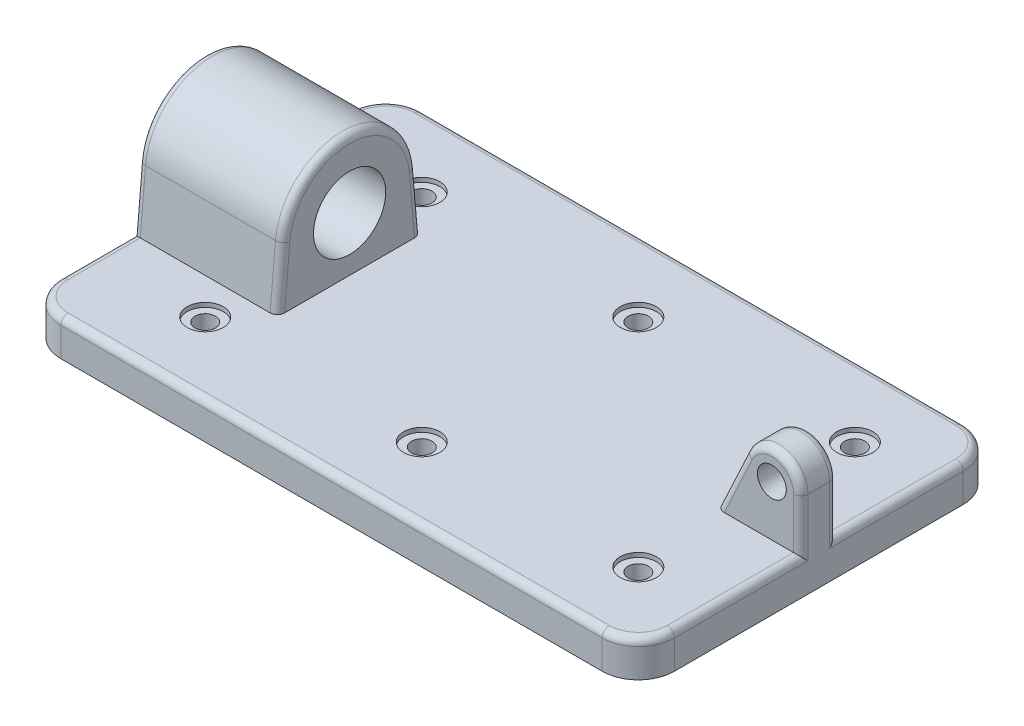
ISO-10303-21;
HEADER;
FILE_DESCRIPTION(('STEP AP214'),'2;1');
FILE_NAME('part.step','',(''),(''),'','','');
FILE_SCHEMA(('AUTOMOTIVE_DESIGN { 1 0 10303 214 1 1 1 1 }'));
ENDSEC;
DATA;
#1=APPLICATION_CONTEXT('core data for automotive mechanical design processes');
#2=APPLICATION_PROTOCOL_DEFINITION('international standard','automotive_design',2000,#1);
#3=PRODUCT_CONTEXT('',#1,'mechanical');
#4=PRODUCT('Part','Part','',(#3));
#5=PRODUCT_RELATED_PRODUCT_CATEGORY('part','',(#4));
#6=PRODUCT_DEFINITION_FORMATION('','',#4);
#7=PRODUCT_DEFINITION_CONTEXT('part definition',#1,'design');
#8=PRODUCT_DEFINITION('design','',#6,#7);
#9=PRODUCT_DEFINITION_SHAPE('','',#8);
#10=(LENGTH_UNIT() NAMED_UNIT(*) SI_UNIT(.MILLI.,.METRE.));
#11=(NAMED_UNIT(*) PLANE_ANGLE_UNIT() SI_UNIT($,.RADIAN.));
#12=(NAMED_UNIT(*) SI_UNIT($,.STERADIAN.) SOLID_ANGLE_UNIT());
#13=UNCERTAINTY_MEASURE_WITH_UNIT(LENGTH_MEASURE(1.E-05),#10,'distance_accuracy_value','');
#14=(GEOMETRIC_REPRESENTATION_CONTEXT(3) GLOBAL_UNCERTAINTY_ASSIGNED_CONTEXT((#13)) GLOBAL_UNIT_ASSIGNED_CONTEXT((#10,
#11,#12)) REPRESENTATION_CONTEXT('',''));
#15=CARTESIAN_POINT('',(0.,0.,0.));
#16=DIRECTION('',(0.,0.,1.));
#17=DIRECTION('',(1.,0.,0.));
#18=AXIS2_PLACEMENT_3D('',#15,#16,#17);
#19=CARTESIAN_POINT('',(107.95,6.34999999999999,31.75));
#20=DIRECTION('',(0.,-1.,0.));
#21=DIRECTION('',(1.,0.,0.));
#22=AXIS2_PLACEMENT_3D('',#19,#20,#21);
#23=PLANE('',#22);
#24=DIRECTION('',(1.,0.,0.));
#25=VECTOR('',#24,1.);
#26=CARTESIAN_POINT('',(93.1193650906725,6.34999999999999,-3.175));
#27=LINE('',#26,#25);
#28=CARTESIAN_POINT('',(94.5206550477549,6.34999999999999,-3.175));
#29=VERTEX_POINT('',#28);
#30=CARTESIAN_POINT('',(106.68,6.34999999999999,-3.175));
#31=VERTEX_POINT('',#30);
#32=EDGE_CURVE('E273',#29,#31,#27,.T.);
#33=ORIENTED_EDGE('',*,*,#32,.T.);
#34=DIRECTION('',(0.,0.,-1.));
#35=VECTOR('',#34,1.);
#36=CARTESIAN_POINT('',(106.68,6.34999999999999,-25.4));
#37=LINE('',#36,#35);
#38=CARTESIAN_POINT('',(106.68,6.34999999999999,-25.4));
#39=VERTEX_POINT('',#38);
#40=EDGE_CURVE('E550',#31,#39,#37,.T.);
#41=ORIENTED_EDGE('',*,*,#40,.T.);
#42=CARTESIAN_POINT('',(101.6,6.34999999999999,-25.4));
#43=DIRECTION('',(0.,-1.,0.));
#44=DIRECTION('',(1.,0.,0.));
#45=AXIS2_PLACEMENT_3D('',#42,#43,#44);
#46=CIRCLE('',#45,5.08);
#47=CARTESIAN_POINT('',(101.6,6.34999999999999,-30.48));
#48=VERTEX_POINT('',#47);
#49=EDGE_CURVE('E563',#39,#48,#46,.F.);
#50=ORIENTED_EDGE('',*,*,#49,.T.);
#51=DIRECTION('',(-1.,0.,0.));
#52=VECTOR('',#51,1.);
#53=CARTESIAN_POINT('',(6.34999999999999,6.35000000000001,-30.48));
#54=LINE('',#53,#52);
#55=CARTESIAN_POINT('',(6.35,6.35000000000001,-30.48));
#56=VERTEX_POINT('',#55);
#57=EDGE_CURVE('E603',#48,#56,#54,.T.);
#58=ORIENTED_EDGE('',*,*,#57,.T.);
#59=CARTESIAN_POINT('',(6.35,6.35000000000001,-25.4));
#60=DIRECTION('',(0.,-1.,0.));
#61=DIRECTION('',(1.,0.,0.));
#62=AXIS2_PLACEMENT_3D('',#59,#60,#61);
#63=CIRCLE('',#62,5.08);
#64=CARTESIAN_POINT('',(1.27,6.35000000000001,-25.4));
#65=VERTEX_POINT('',#64);
#66=EDGE_CURVE('E610',#56,#65,#63,.F.);
#67=ORIENTED_EDGE('',*,*,#66,.T.);
#68=DIRECTION('',(0.,0.,-1.));
#69=VECTOR('',#68,1.);
#70=CARTESIAN_POINT('',(1.27,6.35000000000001,-12.7));
#71=LINE('',#70,#69);
#72=CARTESIAN_POINT('',(1.27,6.35000000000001,-12.7));
#73=VERTEX_POINT('',#72);
#74=EDGE_CURVE('E502',#65,#73,#71,.F.);
#75=ORIENTED_EDGE('',*,*,#74,.T.);
#76=DIRECTION('',(-1.,0.,0.));
#77=VECTOR('',#76,1.);
#78=CARTESIAN_POINT('',(25.4,6.35000000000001,-12.7));
#79=LINE('',#78,#77);
#80=CARTESIAN_POINT('',(24.13,6.35000000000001,-12.7));
#81=VERTEX_POINT('',#80);
#82=EDGE_CURVE('E301',#81,#73,#79,.T.);
#83=ORIENTED_EDGE('',*,*,#82,.F.);
#84=CARTESIAN_POINT('',(24.13,6.35,-11.4251488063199));
#85=DIRECTION('',(0.,-1.,0.));
#86=DIRECTION('',(0.,0.,-1.));
#87=AXIS2_PLACEMENT_3D('',#84,#85,#86);
#88=ELLIPSE('',#87,1.27485119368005,1.27);
#89=CARTESIAN_POINT('',(25.4,6.35000000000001,-11.4251488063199));
#90=VERTEX_POINT('',#89);
#91=EDGE_CURVE('E36',#81,#90,#88,.T.);
#92=ORIENTED_EDGE('',*,*,#91,.T.);
#93=DIRECTION('',(0.,0.,1.));
#94=VECTOR('',#93,1.);
#95=CARTESIAN_POINT('',(25.4,6.35000000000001,-12.7));
#96=LINE('',#95,#94);
#97=CARTESIAN_POINT('',(25.4,6.35000000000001,11.4251488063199));
#98=VERTEX_POINT('',#97);
#99=EDGE_CURVE('E267',#90,#98,#96,.T.);
#100=ORIENTED_EDGE('',*,*,#99,.T.);
#101=CARTESIAN_POINT('',(24.13,6.35,11.4251488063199));
#102=DIRECTION('',(0.,-1.,0.));
#103=DIRECTION('',(0.,0.,-1.));
#104=AXIS2_PLACEMENT_3D('',#101,#102,#103);
#105=ELLIPSE('',#104,1.27485119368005,1.27);
#106=CARTESIAN_POINT('',(24.13,6.35000000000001,12.7));
#107=VERTEX_POINT('',#106);
#108=EDGE_CURVE('E11',#98,#107,#105,.T.);
#109=ORIENTED_EDGE('',*,*,#108,.T.);
#110=DIRECTION('',(-1.,0.,0.));
#111=VECTOR('',#110,1.);
#112=CARTESIAN_POINT('',(25.4,6.35000000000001,12.7));
#113=LINE('',#112,#111);
#114=CARTESIAN_POINT('',(1.27,6.35000000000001,12.7));
#115=VERTEX_POINT('',#114);
#116=EDGE_CURVE('E292',#107,#115,#113,.T.);
#117=ORIENTED_EDGE('',*,*,#116,.T.);
#118=DIRECTION('',(0.,0.,-1.));
#119=VECTOR('',#118,1.);
#120=CARTESIAN_POINT('',(1.27,6.35000000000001,25.4));
#121=LINE('',#120,#119);
#122=CARTESIAN_POINT('',(1.27,6.35000000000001,25.4));
#123=VERTEX_POINT('',#122);
#124=EDGE_CURVE('E597',#115,#123,#121,.F.);
#125=ORIENTED_EDGE('',*,*,#124,.T.);
#126=CARTESIAN_POINT('',(6.35,6.35000000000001,25.4));
#127=DIRECTION('',(0.,-1.,0.));
#128=DIRECTION('',(1.,0.,0.));
#129=AXIS2_PLACEMENT_3D('',#126,#127,#128);
#130=CIRCLE('',#129,5.08);
#131=CARTESIAN_POINT('',(6.35,6.35000000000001,30.48));
#132=VERTEX_POINT('',#131);
#133=EDGE_CURVE('E605',#123,#132,#130,.F.);
#134=ORIENTED_EDGE('',*,*,#133,.T.);
#135=DIRECTION('',(-1.,0.,0.));
#136=VECTOR('',#135,1.);
#137=CARTESIAN_POINT('',(107.95,6.34999999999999,30.48));
#138=LINE('',#137,#136);
#139=CARTESIAN_POINT('',(101.6,6.34999999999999,30.48));
#140=VERTEX_POINT('',#139);
#141=EDGE_CURVE('E263',#132,#140,#138,.F.);
#142=ORIENTED_EDGE('',*,*,#141,.T.);
#143=CARTESIAN_POINT('',(101.6,6.34999999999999,25.4));
#144=DIRECTION('',(0.,-1.,0.));
#145=DIRECTION('',(1.,0.,0.));
#146=AXIS2_PLACEMENT_3D('',#143,#144,#145);
#147=CIRCLE('',#146,5.08);
#148=CARTESIAN_POINT('',(106.68,6.34999999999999,25.4));
#149=VERTEX_POINT('',#148);
#150=EDGE_CURVE('E601',#140,#149,#147,.F.);
#151=ORIENTED_EDGE('',*,*,#150,.T.);
#152=DIRECTION('',(0.,0.,-1.));
#153=VECTOR('',#152,1.);
#154=CARTESIAN_POINT('',(106.68,6.34999999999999,3.175));
#155=LINE('',#154,#153);
#156=CARTESIAN_POINT('',(106.68,6.34999999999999,3.175));
#157=VERTEX_POINT('',#156);
#158=EDGE_CURVE('E600',#149,#157,#155,.T.);
#159=ORIENTED_EDGE('',*,*,#158,.T.);
#160=DIRECTION('',(1.,0.,0.));
#161=VECTOR('',#160,1.);
#162=CARTESIAN_POINT('',(93.1193650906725,6.34999999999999,3.175));
#163=LINE('',#162,#161);
#164=CARTESIAN_POINT('',(94.5206550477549,6.34999999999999,3.175));
#165=VERTEX_POINT('',#164);
#166=EDGE_CURVE('E269',#165,#157,#163,.T.);
#167=ORIENTED_EDGE('',*,*,#166,.F.);
#168=CARTESIAN_POINT('',(94.5206550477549,6.34999999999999,1.905));
#169=DIRECTION('',(0.,-1.,0.));
#170=DIRECTION('',(1.,0.,0.));
#171=AXIS2_PLACEMENT_3D('',#168,#169,#170);
#172=ELLIPSE('',#171,1.40128995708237,1.27);
#173=CARTESIAN_POINT('',(93.1193650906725,6.34999999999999,1.905));
#174=VERTEX_POINT('',#173);
#175=EDGE_CURVE('E493',#165,#174,#172,.T.);
#176=ORIENTED_EDGE('',*,*,#175,.T.);
#177=DIRECTION('',(0.,0.,-1.));
#178=VECTOR('',#177,1.);
#179=CARTESIAN_POINT('',(93.1193650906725,6.34999999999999,3.175));
#180=LINE('',#179,#178);
#181=CARTESIAN_POINT('',(93.1193650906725,6.34999999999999,-1.905));
#182=VERTEX_POINT('',#181);
#183=EDGE_CURVE('E272',#174,#182,#180,.T.);
#184=ORIENTED_EDGE('',*,*,#183,.T.);
#185=CARTESIAN_POINT('',(94.5206550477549,6.34999999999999,-1.905));
#186=DIRECTION('',(0.,-1.,0.));
#187=DIRECTION('',(-1.,0.,0.));
#188=AXIS2_PLACEMENT_3D('',#185,#186,#187);
#189=ELLIPSE('',#188,1.40128995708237,1.27);
#190=EDGE_CURVE('E495',#182,#29,#189,.T.);
#191=ORIENTED_EDGE('',*,*,#190,.T.);
#192=EDGE_LOOP('',(#33,#41,#50,#58,#67,#75,#83,#92,#100,#109,#117,#125,#134,#142,#151,#159,#167,
#176,#184,#191));
#193=FACE_BOUND('',#192,.T.);
#194=CARTESIAN_POINT('',(19.05,6.34999999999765,19.05));
#195=DIRECTION('',(0.,1.,0.));
#196=DIRECTION('',(0.,0.,1.));
#197=AXIS2_PLACEMENT_3D('',#194,#195,#196);
#198=CIRCLE('',#197,3.17499999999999);
#199=CARTESIAN_POINT('',(19.05,6.34999999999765,22.225));
#200=VERTEX_POINT('',#199);
#201=EDGE_CURVE('E362',#200,#200,#198,.T.);
#202=ORIENTED_EDGE('',*,*,#201,.F.);
#203=EDGE_LOOP('',(#202));
#204=FACE_BOUND('',#203,.T.);
#205=CARTESIAN_POINT('',(57.15,6.34999999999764,19.05));
#206=DIRECTION('',(0.,1.,0.));
#207=DIRECTION('',(0.,0.,1.));
#208=AXIS2_PLACEMENT_3D('',#205,#206,#207);
#209=CIRCLE('',#208,3.17499999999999);
#210=CARTESIAN_POINT('',(57.15,6.34999999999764,22.225));
#211=VERTEX_POINT('',#210);
#212=EDGE_CURVE('E338',#211,#211,#209,.T.);
#213=ORIENTED_EDGE('',*,*,#212,.F.);
#214=EDGE_LOOP('',(#213));
#215=FACE_BOUND('',#214,.T.);
#216=CARTESIAN_POINT('',(95.25,6.34999999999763,19.05));
#217=DIRECTION('',(0.,1.,0.));
#218=DIRECTION('',(0.,0.,1.));
#219=AXIS2_PLACEMENT_3D('',#216,#217,#218);
#220=CIRCLE('',#219,3.17499999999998);
#221=CARTESIAN_POINT('',(95.25,6.34999999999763,22.225));
#222=VERTEX_POINT('',#221);
#223=EDGE_CURVE('E314',#222,#222,#220,.T.);
#224=ORIENTED_EDGE('',*,*,#223,.F.);
#225=EDGE_LOOP('',(#224));
#226=FACE_BOUND('',#225,.T.);
#227=CARTESIAN_POINT('',(95.25,6.34999999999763,-19.05));
#228=DIRECTION('',(0.,1.,0.));
#229=DIRECTION('',(0.,0.,1.));
#230=AXIS2_PLACEMENT_3D('',#227,#228,#229);
#231=CIRCLE('',#230,3.17499999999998);
#232=CARTESIAN_POINT('',(95.25,6.34999999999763,-15.875));
#233=VERTEX_POINT('',#232);
#234=EDGE_CURVE('E326',#233,#233,#231,.T.);
#235=ORIENTED_EDGE('',*,*,#234,.F.);
#236=EDGE_LOOP('',(#235));
#237=FACE_BOUND('',#236,.T.);
#238=CARTESIAN_POINT('',(57.15,6.34999999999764,-19.05));
#239=DIRECTION('',(0.,1.,0.));
#240=DIRECTION('',(0.,0.,1.));
#241=AXIS2_PLACEMENT_3D('',#238,#239,#240);
#242=CIRCLE('',#241,3.17499999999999);
#243=CARTESIAN_POINT('',(57.15,6.34999999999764,-15.875));
#244=VERTEX_POINT('',#243);
#245=EDGE_CURVE('E350',#244,#244,#242,.T.);
#246=ORIENTED_EDGE('',*,*,#245,.F.);
#247=EDGE_LOOP('',(#246));
#248=FACE_BOUND('',#247,.T.);
#249=CARTESIAN_POINT('',(19.05,6.34999999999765,-19.05));
#250=DIRECTION('',(0.,1.,0.));
#251=DIRECTION('',(0.,0.,1.));
#252=AXIS2_PLACEMENT_3D('',#249,#250,#251);
#253=CIRCLE('',#252,3.17499999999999);
#254=CARTESIAN_POINT('',(19.05,6.34999999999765,-15.875));
#255=VERTEX_POINT('',#254);
#256=EDGE_CURVE('E374',#255,#255,#253,.T.);
#257=ORIENTED_EDGE('',*,*,#256,.F.);
#258=EDGE_LOOP('',(#257));
#259=FACE_BOUND('',#258,.T.);
#260=ADVANCED_FACE('F28',(#193,#204,#215,#226,#237,#248,#259),#23,.F.);
#261=CARTESIAN_POINT('',(0.,0.,31.75));
#262=DIRECTION('',(-1.,0.,0.));
#263=DIRECTION('',(0.,0.,1.));
#264=AXIS2_PLACEMENT_3D('',#261,#262,#263);
#265=PLANE('',#264);
#266=DIRECTION('',(0.,0.996194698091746,0.0871557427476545));
#267=VECTOR('',#266,1.);
#268=CARTESIAN_POINT('',(0.,6.23931220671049,-11.4348327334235));
#269=LINE('',#268,#267);
#270=CARTESIAN_POINT('',(0.,16.7946250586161,-10.5113625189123));
#271=VERTEX_POINT('',#270);
#272=CARTESIAN_POINT('',(0.,5.08000000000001,-11.5362594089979));
#273=VERTEX_POINT('',#272);
#274=EDGE_CURVE('E523',#271,#273,#269,.F.);
#275=ORIENTED_EDGE('',*,*,#274,.T.);
#276=DIRECTION('',(0.,0.,-1.));
#277=VECTOR('',#276,1.);
#278=CARTESIAN_POINT('',(0.,5.08000000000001,-25.4));
#279=LINE('',#278,#277);
#280=CARTESIAN_POINT('',(0.,5.08000000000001,-25.4));
#281=VERTEX_POINT('',#280);
#282=EDGE_CURVE('E516',#273,#281,#279,.T.);
#283=ORIENTED_EDGE('',*,*,#282,.T.);
#284=DIRECTION('',(0.,1.,0.));
#285=VECTOR('',#284,1.);
#286=CARTESIAN_POINT('',(0.,0.,-25.4));
#287=LINE('',#286,#285);
#288=CARTESIAN_POINT('',(0.,0.,-25.4));
#289=VERTEX_POINT('',#288);
#290=EDGE_CURVE('E244',#281,#289,#287,.F.);
#291=ORIENTED_EDGE('',*,*,#290,.T.);
#292=DIRECTION('',(0.,0.,-1.));
#293=VECTOR('',#292,1.);
#294=CARTESIAN_POINT('',(0.,0.,31.75));
#295=LINE('',#294,#293);
#296=CARTESIAN_POINT('',(0.,0.,25.4));
#297=VERTEX_POINT('',#296);
#298=EDGE_CURVE('E220',#297,#289,#295,.T.);
#299=ORIENTED_EDGE('',*,*,#298,.F.);
#300=DIRECTION('',(0.,1.,0.));
#301=VECTOR('',#300,1.);
#302=CARTESIAN_POINT('',(0.,6.35000000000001,25.4));
#303=LINE('',#302,#301);
#304=CARTESIAN_POINT('',(0.,5.08000000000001,25.4));
#305=VERTEX_POINT('',#304);
#306=EDGE_CURVE('E241',#297,#305,#303,.T.);
#307=ORIENTED_EDGE('',*,*,#306,.T.);
#308=DIRECTION('',(0.,0.,-1.));
#309=VECTOR('',#308,1.);
#310=CARTESIAN_POINT('',(0.,5.08000000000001,12.7));
#311=LINE('',#310,#309);
#312=CARTESIAN_POINT('',(0.,5.08000000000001,11.5362594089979));
#313=VERTEX_POINT('',#312);
#314=EDGE_CURVE('E519',#305,#313,#311,.T.);
#315=ORIENTED_EDGE('',*,*,#314,.T.);
#316=DIRECTION('',(0.,0.996194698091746,-0.0871557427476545));
#317=VECTOR('',#316,1.);
#318=CARTESIAN_POINT('',(0.,-1.71645130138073,12.1308718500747));
#319=LINE('',#318,#317);
#320=CARTESIAN_POINT('',(0.,16.7946250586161,10.5113625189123));
#321=VERTEX_POINT('',#320);
#322=EDGE_CURVE('E574',#313,#321,#319,.T.);
#323=ORIENTED_EDGE('',*,*,#322,.T.);
#324=CARTESIAN_POINT('',(0.,15.875,0.));
#325=DIRECTION('',(-1.,0.,0.));
#326=DIRECTION('',(0.,0.,1.));
#327=AXIS2_PLACEMENT_3D('',#324,#325,#326);
#328=CIRCLE('',#327,10.5515142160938);
#329=EDGE_CURVE('E572',#321,#271,#328,.T.);
#330=ORIENTED_EDGE('',*,*,#329,.T.);
#331=EDGE_LOOP('',(#275,#283,#291,#299,#307,#315,#323,#330));
#332=FACE_BOUND('',#331,.T.);
#333=CARTESIAN_POINT('',(0.,15.875,0.));
#334=DIRECTION('',(1.,0.,0.));
#335=DIRECTION('',(0.,0.,-1.));
#336=AXIS2_PLACEMENT_3D('',#333,#334,#335);
#337=CIRCLE('',#336,6.34999999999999);
#338=CARTESIAN_POINT('',(0.,15.875,-6.34999999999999));
#339=VERTEX_POINT('',#338);
#340=EDGE_CURVE('E311',#339,#339,#337,.T.);
#341=ORIENTED_EDGE('',*,*,#340,.T.);
#342=EDGE_LOOP('',(#341));
#343=FACE_BOUND('',#342,.T.);
#344=ADVANCED_FACE('F30',(#332,#343),#265,.T.);
#345=CARTESIAN_POINT('',(25.4,15.875,0.));
#346=DIRECTION('',(1.,0.,0.));
#347=DIRECTION('',(0.,0.,-1.));
#348=AXIS2_PLACEMENT_3D('',#345,#346,#347);
#349=PLANE('',#348);
#350=ORIENTED_EDGE('',*,*,#99,.F.);
#351=DIRECTION('',(0.,0.996194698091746,0.0871557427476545));
#352=VECTOR('',#351,1.);
#353=CARTESIAN_POINT('',(25.4,16.7946250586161,-10.5113625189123));
#354=LINE('',#353,#352);
#355=CARTESIAN_POINT('',(25.4,16.7946250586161,-10.5113625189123));
#356=VERTEX_POINT('',#355);
#357=EDGE_CURVE('E451',#90,#356,#354,.T.);
#358=ORIENTED_EDGE('',*,*,#357,.T.);
#359=CARTESIAN_POINT('',(25.4,15.875,0.));
#360=DIRECTION('',(1.,0.,0.));
#361=DIRECTION('',(0.,0.,-1.));
#362=AXIS2_PLACEMENT_3D('',#359,#360,#361);
#363=CIRCLE('',#362,10.5515142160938);
#364=CARTESIAN_POINT('',(25.4,16.7946250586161,10.5113625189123));
#365=VERTEX_POINT('',#364);
#366=EDGE_CURVE('E455',#356,#365,#363,.T.);
#367=ORIENTED_EDGE('',*,*,#366,.T.);
#368=DIRECTION('',(0.,0.996194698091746,-0.0871557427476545));
#369=VECTOR('',#368,1.);
#370=CARTESIAN_POINT('',(25.4,16.7946250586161,10.5113625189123));
#371=LINE('',#370,#369);
#372=EDGE_CURVE('E460',#365,#98,#371,.F.);
#373=ORIENTED_EDGE('',*,*,#372,.T.);
#374=EDGE_LOOP('',(#350,#358,#367,#373));
#375=FACE_BOUND('',#374,.T.);
#376=CARTESIAN_POINT('',(25.3999999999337,15.875,0.));
#377=DIRECTION('',(1.,0.,0.));
#378=DIRECTION('',(0.,0.,-1.));
#379=AXIS2_PLACEMENT_3D('',#376,#377,#378);
#380=CIRCLE('',#379,6.34999999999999);
#381=CARTESIAN_POINT('',(25.3999999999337,15.875,-6.34999999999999));
#382=VERTEX_POINT('',#381);
#383=EDGE_CURVE('E308',#382,#382,#380,.T.);
#384=ORIENTED_EDGE('',*,*,#383,.F.);
#385=EDGE_LOOP('',(#384));
#386=FACE_BOUND('',#385,.T.);
#387=ADVANCED_FACE('F464',(#375,#386),#349,.T.);
#388=CARTESIAN_POINT('',(102.87,15.24,3.175));
#389=DIRECTION('',(0.,0.,1.));
#390=DIRECTION('',(1.,0.,0.));
#391=AXIS2_PLACEMENT_3D('',#388,#389,#390);
#392=PLANE('',#391);
#393=ORIENTED_EDGE('',*,*,#166,.T.);
#394=DIRECTION('',(0.,1.,0.));
#395=VECTOR('',#394,1.);
#396=CARTESIAN_POINT('',(106.68,15.24,3.175));
#397=LINE('',#396,#395);
#398=CARTESIAN_POINT('',(106.68,15.24,3.175));
#399=VERTEX_POINT('',#398);
#400=EDGE_CURVE('E528',#157,#399,#397,.T.);
#401=ORIENTED_EDGE('',*,*,#400,.T.);
#402=CARTESIAN_POINT('',(102.87,15.24,3.175));
#403=DIRECTION('',(0.,0.,1.));
#404=DIRECTION('',(1.,0.,0.));
#405=AXIS2_PLACEMENT_3D('',#402,#403,#404);
#406=CIRCLE('',#405,3.80999999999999);
#407=CARTESIAN_POINT('',(99.4169673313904,16.8501755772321,3.175));
#408=VERTEX_POINT('',#407);
#409=EDGE_CURVE('E518',#399,#408,#406,.T.);
#410=ORIENTED_EDGE('',*,*,#409,.T.);
#411=DIRECTION('',(-0.422618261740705,-0.906307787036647,0.));
#412=VECTOR('',#411,1.);
#413=CARTESIAN_POINT('',(94.2703759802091,5.81327480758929,3.175));
#414=LINE('',#413,#412);
#415=EDGE_CURVE('E521',#408,#165,#414,.T.);
#416=ORIENTED_EDGE('',*,*,#415,.T.);
#417=EDGE_LOOP('',(#393,#401,#410,#416));
#418=FACE_BOUND('',#417,.T.);
#419=CARTESIAN_POINT('',(102.87,15.24,3.175));
#420=DIRECTION('',(0.,0.,1.));
#421=DIRECTION('',(1.,0.,0.));
#422=AXIS2_PLACEMENT_3D('',#419,#420,#421);
#423=CIRCLE('',#422,2.53999999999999);
#424=CARTESIAN_POINT('',(105.41,15.24,3.175));
#425=VERTEX_POINT('',#424);
#426=EDGE_CURVE('E268',#425,#425,#423,.T.);
#427=ORIENTED_EDGE('',*,*,#426,.F.);
#428=EDGE_LOOP('',(#427));
#429=FACE_BOUND('',#428,.T.);
#430=ADVANCED_FACE('F667',(#418,#429),#392,.T.);
#431=CARTESIAN_POINT('',(102.87,15.24,-3.175));
#432=DIRECTION('',(0.,0.,1.));
#433=DIRECTION('',(1.,0.,0.));
#434=AXIS2_PLACEMENT_3D('',#431,#432,#433);
#435=PLANE('',#434);
#436=CARTESIAN_POINT('',(102.87,15.24,-3.175));
#437=DIRECTION('',(0.,0.,1.));
#438=DIRECTION('',(1.,0.,0.));
#439=AXIS2_PLACEMENT_3D('',#436,#437,#438);
#440=CIRCLE('',#439,3.80999999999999);
#441=CARTESIAN_POINT('',(99.4169673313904,16.8501755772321,-3.175));
#442=VERTEX_POINT('',#441);
#443=CARTESIAN_POINT('',(106.68,15.24,-3.175));
#444=VERTEX_POINT('',#443);
#445=EDGE_CURVE('E534',#442,#444,#440,.F.);
#446=ORIENTED_EDGE('',*,*,#445,.T.);
#447=DIRECTION('',(0.,1.,0.));
#448=VECTOR('',#447,1.);
#449=CARTESIAN_POINT('',(106.68,6.34999999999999,-3.175));
#450=LINE('',#449,#448);
#451=EDGE_CURVE('E461',#444,#31,#450,.F.);
#452=ORIENTED_EDGE('',*,*,#451,.T.);
#453=ORIENTED_EDGE('',*,*,#32,.F.);
#454=DIRECTION('',(-0.422618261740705,-0.906307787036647,0.));
#455=VECTOR('',#454,1.);
#456=CARTESIAN_POINT('',(99.4169673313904,16.8501755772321,-3.175));
#457=LINE('',#456,#455);
#458=EDGE_CURVE('E536',#29,#442,#457,.F.);
#459=ORIENTED_EDGE('',*,*,#458,.T.);
#460=EDGE_LOOP('',(#446,#452,#453,#459));
#461=FACE_BOUND('',#460,.T.);
#462=CARTESIAN_POINT('',(102.87,15.24,-3.175));
#463=DIRECTION('',(0.,0.,1.));
#464=DIRECTION('',(1.,0.,0.));
#465=AXIS2_PLACEMENT_3D('',#462,#463,#464);
#466=CIRCLE('',#465,2.54);
#467=CARTESIAN_POINT('',(105.41,15.24,-3.175));
#468=VERTEX_POINT('',#467);
#469=EDGE_CURVE('E264',#468,#468,#466,.F.);
#470=ORIENTED_EDGE('',*,*,#469,.F.);
#471=EDGE_LOOP('',(#470));
#472=FACE_BOUND('',#471,.T.);
#473=ADVANCED_FACE('F541',(#461,#472),#435,.F.);
#474=CARTESIAN_POINT('',(0.,0.,31.75));
#475=DIRECTION('',(0.,1.,0.));
#476=DIRECTION('',(-1.,0.,0.));
#477=AXIS2_PLACEMENT_3D('',#474,#475,#476);
#478=PLANE('',#477);
#479=CARTESIAN_POINT('',(19.05,0.,-19.05));
#480=DIRECTION('',(0.,1.,0.));
#481=DIRECTION('',(0.,0.,1.));
#482=AXIS2_PLACEMENT_3D('',#479,#480,#481);
#483=CIRCLE('',#482,1.80339999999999);
#484=CARTESIAN_POINT('',(19.05,0.,-17.2466));
#485=VERTEX_POINT('',#484);
#486=EDGE_CURVE('E383',#485,#485,#483,.T.);
#487=ORIENTED_EDGE('',*,*,#486,.T.);
#488=EDGE_LOOP('',(#487));
#489=FACE_BOUND('',#488,.T.);
#490=CARTESIAN_POINT('',(19.05,0.,19.05));
#491=DIRECTION('',(0.,1.,0.));
#492=DIRECTION('',(0.,0.,1.));
#493=AXIS2_PLACEMENT_3D('',#490,#491,#492);
#494=CIRCLE('',#493,1.80339999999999);
#495=CARTESIAN_POINT('',(19.05,0.,20.8534));
#496=VERTEX_POINT('',#495);
#497=EDGE_CURVE('E371',#496,#496,#494,.T.);
#498=ORIENTED_EDGE('',*,*,#497,.T.);
#499=EDGE_LOOP('',(#498));
#500=FACE_BOUND('',#499,.T.);
#501=CARTESIAN_POINT('',(57.15,0.,-19.05));
#502=DIRECTION('',(0.,1.,0.));
#503=DIRECTION('',(0.,0.,1.));
#504=AXIS2_PLACEMENT_3D('',#501,#502,#503);
#505=CIRCLE('',#504,1.80339999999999);
#506=CARTESIAN_POINT('',(57.15,0.,-17.2466));
#507=VERTEX_POINT('',#506);
#508=EDGE_CURVE('E359',#507,#507,#505,.T.);
#509=ORIENTED_EDGE('',*,*,#508,.T.);
#510=EDGE_LOOP('',(#509));
#511=FACE_BOUND('',#510,.T.);
#512=CARTESIAN_POINT('',(57.15,0.,19.05));
#513=DIRECTION('',(0.,1.,0.));
#514=DIRECTION('',(0.,0.,1.));
#515=AXIS2_PLACEMENT_3D('',#512,#513,#514);
#516=CIRCLE('',#515,1.80339999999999);
#517=CARTESIAN_POINT('',(57.15,0.,20.8534));
#518=VERTEX_POINT('',#517);
#519=EDGE_CURVE('E347',#518,#518,#516,.T.);
#520=ORIENTED_EDGE('',*,*,#519,.T.);
#521=EDGE_LOOP('',(#520));
#522=FACE_BOUND('',#521,.T.);
#523=CARTESIAN_POINT('',(95.25,0.,-19.05));
#524=DIRECTION('',(0.,1.,0.));
#525=DIRECTION('',(0.,0.,1.));
#526=AXIS2_PLACEMENT_3D('',#523,#524,#525);
#527=CIRCLE('',#526,1.80339999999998);
#528=CARTESIAN_POINT('',(95.25,0.,-17.2466));
#529=VERTEX_POINT('',#528);
#530=EDGE_CURVE('E335',#529,#529,#527,.T.);
#531=ORIENTED_EDGE('',*,*,#530,.T.);
#532=EDGE_LOOP('',(#531));
#533=FACE_BOUND('',#532,.T.);
#534=CARTESIAN_POINT('',(95.25,0.,19.05));
#535=DIRECTION('',(0.,1.,0.));
#536=DIRECTION('',(0.,0.,1.));
#537=AXIS2_PLACEMENT_3D('',#534,#535,#536);
#538=CIRCLE('',#537,1.80339999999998);
#539=CARTESIAN_POINT('',(95.25,0.,20.8534));
#540=VERTEX_POINT('',#539);
#541=EDGE_CURVE('E323',#540,#540,#538,.T.);
#542=ORIENTED_EDGE('',*,*,#541,.T.);
#543=EDGE_LOOP('',(#542));
#544=FACE_BOUND('',#543,.T.);
#545=ORIENTED_EDGE('',*,*,#298,.T.);
#546=CARTESIAN_POINT('',(6.35,0.,-25.4));
#547=DIRECTION('',(0.,1.,0.));
#548=DIRECTION('',(-1.,0.,0.));
#549=AXIS2_PLACEMENT_3D('',#546,#547,#548);
#550=CIRCLE('',#549,6.35);
#551=CARTESIAN_POINT('',(6.35,0.,-31.75));
#552=VERTEX_POINT('',#551);
#553=EDGE_CURVE('E215',#289,#552,#550,.F.);
#554=ORIENTED_EDGE('',*,*,#553,.T.);
#555=DIRECTION('',(1.,0.,0.));
#556=VECTOR('',#555,1.);
#557=CARTESIAN_POINT('',(0.,0.,-31.75));
#558=LINE('',#557,#556);
#559=CARTESIAN_POINT('',(101.6,0.,-31.75));
#560=VERTEX_POINT('',#559);
#561=EDGE_CURVE('E218',#552,#560,#558,.T.);
#562=ORIENTED_EDGE('',*,*,#561,.T.);
#563=CARTESIAN_POINT('',(101.6,0.,-25.4));
#564=DIRECTION('',(0.,1.,0.));
#565=DIRECTION('',(-1.,0.,0.));
#566=AXIS2_PLACEMENT_3D('',#563,#564,#565);
#567=CIRCLE('',#566,6.35);
#568=CARTESIAN_POINT('',(107.95,0.,-25.4));
#569=VERTEX_POINT('',#568);
#570=EDGE_CURVE('E250',#560,#569,#567,.F.);
#571=ORIENTED_EDGE('',*,*,#570,.T.);
#572=DIRECTION('',(0.,0.,-1.));
#573=VECTOR('',#572,1.);
#574=CARTESIAN_POINT('',(107.95,0.,31.75));
#575=LINE('',#574,#573);
#576=CARTESIAN_POINT('',(107.95,0.,25.4));
#577=VERTEX_POINT('',#576);
#578=EDGE_CURVE('E278',#577,#569,#575,.T.);
#579=ORIENTED_EDGE('',*,*,#578,.F.);
#580=CARTESIAN_POINT('',(101.6,0.,25.4));
#581=DIRECTION('',(0.,1.,0.));
#582=DIRECTION('',(-1.,0.,0.));
#583=AXIS2_PLACEMENT_3D('',#580,#581,#582);
#584=CIRCLE('',#583,6.35);
#585=CARTESIAN_POINT('',(101.6,0.,31.75));
#586=VERTEX_POINT('',#585);
#587=EDGE_CURVE('E252',#577,#586,#584,.F.);
#588=ORIENTED_EDGE('',*,*,#587,.T.);
#589=DIRECTION('',(1.,0.,0.));
#590=VECTOR('',#589,1.);
#591=CARTESIAN_POINT('',(0.,0.,31.75));
#592=LINE('',#591,#590);
#593=CARTESIAN_POINT('',(6.35,0.,31.75));
#594=VERTEX_POINT('',#593);
#595=EDGE_CURVE('E235',#594,#586,#592,.T.);
#596=ORIENTED_EDGE('',*,*,#595,.F.);
#597=CARTESIAN_POINT('',(6.35,0.,25.4));
#598=DIRECTION('',(0.,1.,0.));
#599=DIRECTION('',(-1.,0.,0.));
#600=AXIS2_PLACEMENT_3D('',#597,#598,#599);
#601=CIRCLE('',#600,6.35);
#602=EDGE_CURVE('E225',#594,#297,#601,.F.);
#603=ORIENTED_EDGE('',*,*,#602,.T.);
#604=EDGE_LOOP('',(#545,#554,#562,#571,#579,#588,#596,#603));
#605=FACE_BOUND('',#604,.T.);
#606=ADVANCED_FACE('F217',(#489,#500,#511,#522,#533,#544,#605),#478,.F.);
#607=CARTESIAN_POINT('',(107.95,6.34999999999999,31.75));
#608=DIRECTION('',(1.,0.,0.));
#609=DIRECTION('',(0.,0.,-1.));
#610=AXIS2_PLACEMENT_3D('',#607,#608,#609);
#611=PLANE('',#610);
#612=DIRECTION('',(0.,1.,0.));
#613=VECTOR('',#612,1.);
#614=CARTESIAN_POINT('',(107.95,6.34999999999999,1.905));
#615=LINE('',#614,#613);
#616=CARTESIAN_POINT('',(107.95,15.24,1.905));
#617=VERTEX_POINT('',#616);
#618=CARTESIAN_POINT('',(107.95,5.07999999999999,1.905));
#619=VERTEX_POINT('',#618);
#620=EDGE_CURVE('E568',#617,#619,#615,.F.);
#621=ORIENTED_EDGE('',*,*,#620,.T.);
#622=DIRECTION('',(0.,0.,-1.));
#623=VECTOR('',#622,1.);
#624=CARTESIAN_POINT('',(107.95,5.07999999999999,25.4));
#625=LINE('',#624,#623);
#626=CARTESIAN_POINT('',(107.95,5.07999999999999,25.4));
#627=VERTEX_POINT('',#626);
#628=EDGE_CURVE('E570',#619,#627,#625,.F.);
#629=ORIENTED_EDGE('',*,*,#628,.T.);
#630=DIRECTION('',(0.,-1.,0.));
#631=VECTOR('',#630,1.);
#632=CARTESIAN_POINT('',(107.95,0.,25.4));
#633=LINE('',#632,#631);
#634=EDGE_CURVE('E261',#627,#577,#633,.T.);
#635=ORIENTED_EDGE('',*,*,#634,.T.);
#636=ORIENTED_EDGE('',*,*,#578,.T.);
#637=DIRECTION('',(0.,-1.,0.));
#638=VECTOR('',#637,1.);
#639=CARTESIAN_POINT('',(107.95,6.34999999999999,-25.4));
#640=LINE('',#639,#638);
#641=CARTESIAN_POINT('',(107.95,5.07999999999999,-25.4));
#642=VERTEX_POINT('',#641);
#643=EDGE_CURVE('E258',#569,#642,#640,.F.);
#644=ORIENTED_EDGE('',*,*,#643,.T.);
#645=DIRECTION('',(0.,0.,-1.));
#646=VECTOR('',#645,1.);
#647=CARTESIAN_POINT('',(107.95,5.07999999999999,-3.175));
#648=LINE('',#647,#646);
#649=CARTESIAN_POINT('',(107.95,5.07999999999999,-1.905));
#650=VERTEX_POINT('',#649);
#651=EDGE_CURVE('E561',#642,#650,#648,.F.);
#652=ORIENTED_EDGE('',*,*,#651,.T.);
#653=DIRECTION('',(0.,1.,0.));
#654=VECTOR('',#653,1.);
#655=CARTESIAN_POINT('',(107.95,15.24,-1.905));
#656=LINE('',#655,#654);
#657=CARTESIAN_POINT('',(107.95,15.24,-1.905));
#658=VERTEX_POINT('',#657);
#659=EDGE_CURVE('E554',#650,#658,#656,.T.);
#660=ORIENTED_EDGE('',*,*,#659,.T.);
#661=DIRECTION('',(0.,0.,-1.));
#662=VECTOR('',#661,1.);
#663=CARTESIAN_POINT('',(107.95,15.24,3.175));
#664=LINE('',#663,#662);
#665=EDGE_CURVE('E236',#617,#658,#664,.T.);
#666=ORIENTED_EDGE('',*,*,#665,.F.);
#667=EDGE_LOOP('',(#621,#629,#635,#636,#644,#652,#660,#666));
#668=FACE_BOUND('',#667,.T.);
#669=ADVANCED_FACE('F624',(#668),#611,.T.);
#670=CARTESIAN_POINT('',(0.,0.,31.75));
#671=DIRECTION('',(0.,0.,-1.));
#672=DIRECTION('',(-1.,0.,0.));
#673=AXIS2_PLACEMENT_3D('',#670,#671,#672);
#674=PLANE('',#673);
#675=DIRECTION('',(0.,-1.,0.));
#676=VECTOR('',#675,1.);
#677=CARTESIAN_POINT('',(101.6,6.34999999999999,31.75));
#678=LINE('',#677,#676);
#679=CARTESIAN_POINT('',(101.6,5.07999999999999,31.75));
#680=VERTEX_POINT('',#679);
#681=EDGE_CURVE('E224',#586,#680,#678,.F.);
#682=ORIENTED_EDGE('',*,*,#681,.T.);
#683=DIRECTION('',(-1.,0.,0.));
#684=VECTOR('',#683,1.);
#685=CARTESIAN_POINT('',(0.,5.08000000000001,31.75));
#686=LINE('',#685,#684);
#687=CARTESIAN_POINT('',(6.35,5.08000000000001,31.75));
#688=VERTEX_POINT('',#687);
#689=EDGE_CURVE('E43',#680,#688,#686,.T.);
#690=ORIENTED_EDGE('',*,*,#689,.T.);
#691=DIRECTION('',(0.,1.,0.));
#692=VECTOR('',#691,1.);
#693=CARTESIAN_POINT('',(6.35,0.,31.75));
#694=LINE('',#693,#692);
#695=EDGE_CURVE('E256',#688,#594,#694,.F.);
#696=ORIENTED_EDGE('',*,*,#695,.T.);
#697=ORIENTED_EDGE('',*,*,#595,.T.);
#698=EDGE_LOOP('',(#682,#690,#696,#697));
#699=FACE_BOUND('',#698,.T.);
#700=ADVANCED_FACE('F629',(#699),#674,.F.);
#701=CARTESIAN_POINT('',(0.,0.,-31.75));
#702=DIRECTION('',(0.,0.,-1.));
#703=DIRECTION('',(-1.,0.,0.));
#704=AXIS2_PLACEMENT_3D('',#701,#702,#703);
#705=PLANE('',#704);
#706=DIRECTION('',(0.,1.,0.));
#707=VECTOR('',#706,1.);
#708=CARTESIAN_POINT('',(6.35,0.,-31.75));
#709=LINE('',#708,#707);
#710=CARTESIAN_POINT('',(6.35,5.08000000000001,-31.75));
#711=VERTEX_POINT('',#710);
#712=EDGE_CURVE('E230',#552,#711,#709,.T.);
#713=ORIENTED_EDGE('',*,*,#712,.T.);
#714=DIRECTION('',(-1.,0.,0.));
#715=VECTOR('',#714,1.);
#716=CARTESIAN_POINT('',(101.6,5.07999999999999,-31.75));
#717=LINE('',#716,#715);
#718=CARTESIAN_POINT('',(101.6,5.07999999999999,-31.75));
#719=VERTEX_POINT('',#718);
#720=EDGE_CURVE('E490',#711,#719,#717,.F.);
#721=ORIENTED_EDGE('',*,*,#720,.T.);
#722=DIRECTION('',(0.,-1.,0.));
#723=VECTOR('',#722,1.);
#724=CARTESIAN_POINT('',(101.6,0.,-31.75));
#725=LINE('',#724,#723);
#726=EDGE_CURVE('E233',#719,#560,#725,.T.);
#727=ORIENTED_EDGE('',*,*,#726,.T.);
#728=ORIENTED_EDGE('',*,*,#561,.F.);
#729=EDGE_LOOP('',(#713,#721,#727,#728));
#730=FACE_BOUND('',#729,.T.);
#731=ADVANCED_FACE('F229',(#730),#705,.T.);
#732=CARTESIAN_POINT('',(102.87,15.24,3.175));
#733=DIRECTION('',(0.,0.,-1.));
#734=DIRECTION('',(-1.,0.,0.));
#735=AXIS2_PLACEMENT_3D('',#732,#733,#734);
#736=CYLINDRICAL_SURFACE('',#735,5.07999999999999);
#737=DIRECTION('',(0.,0.,-1.));
#738=VECTOR('',#737,1.);
#739=CARTESIAN_POINT('',(98.2659564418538,17.3869007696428,3.175));
#740=LINE('',#739,#738);
#741=CARTESIAN_POINT('',(98.2659564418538,17.3869007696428,1.905));
#742=VERTEX_POINT('',#741);
#743=CARTESIAN_POINT('',(98.2659564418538,17.3869007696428,-1.905));
#744=VERTEX_POINT('',#743);
#745=EDGE_CURVE('E286',#742,#744,#740,.T.);
#746=ORIENTED_EDGE('',*,*,#745,.F.);
#747=CARTESIAN_POINT('',(102.87,15.24,1.905));
#748=DIRECTION('',(0.,0.,1.));
#749=DIRECTION('',(1.,0.,0.));
#750=AXIS2_PLACEMENT_3D('',#747,#748,#749);
#751=CIRCLE('',#750,5.07999999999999);
#752=EDGE_CURVE('E484',#742,#617,#751,.F.);
#753=ORIENTED_EDGE('',*,*,#752,.T.);
#754=ORIENTED_EDGE('',*,*,#665,.T.);
#755=CARTESIAN_POINT('',(102.87,15.24,-1.905));
#756=DIRECTION('',(0.,0.,1.));
#757=DIRECTION('',(1.,0.,0.));
#758=AXIS2_PLACEMENT_3D('',#755,#756,#757);
#759=CIRCLE('',#758,5.07999999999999);
#760=EDGE_CURVE('E482',#658,#744,#759,.T.);
#761=ORIENTED_EDGE('',*,*,#760,.T.);
#762=EDGE_LOOP('',(#746,#753,#754,#761));
#763=FACE_BOUND('',#762,.T.);
#764=ADVANCED_FACE('F659',(#763),#736,.T.);
#765=CARTESIAN_POINT('',(98.2659564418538,17.3869007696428,3.175));
#766=DIRECTION('',(0.906307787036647,-0.422618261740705,0.));
#767=DIRECTION('',(0.422618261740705,0.906307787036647,0.));
#768=AXIS2_PLACEMENT_3D('',#765,#766,#767);
#769=PLANE('',#768);
#770=ORIENTED_EDGE('',*,*,#183,.F.);
#771=DIRECTION('',(-0.422618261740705,-0.906307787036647,0.));
#772=VECTOR('',#771,1.);
#773=CARTESIAN_POINT('',(98.2659564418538,17.3869007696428,1.905));
#774=LINE('',#773,#772);
#775=EDGE_CURVE('E532',#174,#742,#774,.F.);
#776=ORIENTED_EDGE('',*,*,#775,.T.);
#777=ORIENTED_EDGE('',*,*,#745,.T.);
#778=DIRECTION('',(-0.422618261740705,-0.906307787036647,0.));
#779=VECTOR('',#778,1.);
#780=CARTESIAN_POINT('',(98.2659564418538,17.3869007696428,-1.905));
#781=LINE('',#780,#779);
#782=EDGE_CURVE('E530',#744,#182,#781,.T.);
#783=ORIENTED_EDGE('',*,*,#782,.T.);
#784=EDGE_LOOP('',(#770,#776,#777,#783));
#785=FACE_BOUND('',#784,.T.);
#786=ADVANCED_FACE('F662',(#785),#769,.F.);
#787=CARTESIAN_POINT('',(25.4,6.35000000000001,-12.7));
#788=DIRECTION('',(0.,-0.0871557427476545,0.996194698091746));
#789=DIRECTION('',(0.,-0.996194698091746,-0.0871557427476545));
#790=AXIS2_PLACEMENT_3D('',#787,#788,#789);
#791=PLANE('',#790);
#792=DIRECTION('',(-1.,0.,0.));
#793=VECTOR('',#792,1.);
#794=CARTESIAN_POINT('',(25.4,16.9053128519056,-11.7765297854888));
#795=LINE('',#794,#793);
#796=CARTESIAN_POINT('',(24.13,16.9053128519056,-11.7765297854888));
#797=VERTEX_POINT('',#796);
#798=CARTESIAN_POINT('',(1.27,16.9053128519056,-11.7765297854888));
#799=VERTEX_POINT('',#798);
#800=EDGE_CURVE('E298',#797,#799,#795,.T.);
#801=ORIENTED_EDGE('',*,*,#800,.F.);
#802=DIRECTION('',(0.,0.996194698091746,0.0871557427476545));
#803=VECTOR('',#802,1.);
#804=CARTESIAN_POINT('',(24.13,6.35000000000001,-12.7));
#805=LINE('',#804,#803);
#806=EDGE_CURVE('E452',#797,#81,#805,.F.);
#807=ORIENTED_EDGE('',*,*,#806,.T.);
#808=ORIENTED_EDGE('',*,*,#82,.T.);
#809=DIRECTION('',(0.,0.996194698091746,0.0871557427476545));
#810=VECTOR('',#809,1.);
#811=CARTESIAN_POINT('',(1.27,16.9053128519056,-11.7765297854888));
#812=LINE('',#811,#810);
#813=EDGE_CURVE('E466',#73,#799,#812,.T.);
#814=ORIENTED_EDGE('',*,*,#813,.T.);
#815=EDGE_LOOP('',(#801,#807,#808,#814));
#816=FACE_BOUND('',#815,.T.);
#817=ADVANCED_FACE('F506',(#816),#791,.F.);
#818=CARTESIAN_POINT('',(25.4,15.875,0.));
#819=DIRECTION('',(-1.,0.,0.));
#820=DIRECTION('',(0.,0.,1.));
#821=AXIS2_PLACEMENT_3D('',#818,#819,#820);
#822=CYLINDRICAL_SURFACE('',#821,11.8215142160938);
#823=DIRECTION('',(-1.,0.,0.));
#824=VECTOR('',#823,1.);
#825=CARTESIAN_POINT('',(25.4,16.9053128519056,11.7765297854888));
#826=LINE('',#825,#824);
#827=CARTESIAN_POINT('',(24.13,16.9053128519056,11.7765297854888));
#828=VERTEX_POINT('',#827);
#829=CARTESIAN_POINT('',(1.27,16.9053128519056,11.7765297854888));
#830=VERTEX_POINT('',#829);
#831=EDGE_CURVE('E295',#828,#830,#826,.T.);
#832=ORIENTED_EDGE('',*,*,#831,.F.);
#833=CARTESIAN_POINT('',(24.13,15.875,0.));
#834=DIRECTION('',(1.,0.,0.));
#835=DIRECTION('',(0.,0.,-1.));
#836=AXIS2_PLACEMENT_3D('',#833,#834,#835);
#837=CIRCLE('',#836,11.8215142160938);
#838=EDGE_CURVE('E488',#828,#797,#837,.F.);
#839=ORIENTED_EDGE('',*,*,#838,.T.);
#840=ORIENTED_EDGE('',*,*,#800,.T.);
#841=CARTESIAN_POINT('',(1.27,15.875,0.));
#842=DIRECTION('',(-1.,0.,0.));
#843=DIRECTION('',(0.,0.,1.));
#844=AXIS2_PLACEMENT_3D('',#841,#842,#843);
#845=CIRCLE('',#844,11.8215142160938);
#846=EDGE_CURVE('E486',#799,#830,#845,.F.);
#847=ORIENTED_EDGE('',*,*,#846,.T.);
#848=EDGE_LOOP('',(#832,#839,#840,#847));
#849=FACE_BOUND('',#848,.T.);
#850=ADVANCED_FACE('F584',(#849),#822,.T.);
#851=CARTESIAN_POINT('',(25.4,6.35000000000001,12.7));
#852=DIRECTION('',(0.,0.0871557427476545,0.996194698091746));
#853=DIRECTION('',(0.,-0.996194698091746,0.0871557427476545));
#854=AXIS2_PLACEMENT_3D('',#851,#852,#853);
#855=PLANE('',#854);
#856=ORIENTED_EDGE('',*,*,#116,.F.);
#857=DIRECTION('',(0.,0.996194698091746,-0.0871557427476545));
#858=VECTOR('',#857,1.);
#859=CARTESIAN_POINT('',(24.13,6.35000000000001,12.7));
#860=LINE('',#859,#858);
#861=EDGE_CURVE('E474',#107,#828,#860,.T.);
#862=ORIENTED_EDGE('',*,*,#861,.T.);
#863=ORIENTED_EDGE('',*,*,#831,.T.);
#864=DIRECTION('',(0.,0.996194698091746,-0.0871557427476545));
#865=VECTOR('',#864,1.);
#866=CARTESIAN_POINT('',(1.27,6.35000000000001,12.7));
#867=LINE('',#866,#865);
#868=EDGE_CURVE('E472',#830,#115,#867,.F.);
#869=ORIENTED_EDGE('',*,*,#868,.T.);
#870=EDGE_LOOP('',(#856,#862,#863,#869));
#871=FACE_BOUND('',#870,.T.);
#872=ADVANCED_FACE('F588',(#871),#855,.T.);
#873=CARTESIAN_POINT('',(6.35,0.,-25.4));
#874=DIRECTION('',(0.,1.,0.));
#875=DIRECTION('',(0.,0.,1.));
#876=AXIS2_PLACEMENT_3D('',#873,#874,#875);
#877=CYLINDRICAL_SURFACE('',#876,6.35);
#878=ORIENTED_EDGE('',*,*,#290,.F.);
#879=CARTESIAN_POINT('',(6.35,5.08000000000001,-25.4));
#880=DIRECTION('',(0.,-1.,0.));
#881=DIRECTION('',(1.,0.,0.));
#882=AXIS2_PLACEMENT_3D('',#879,#880,#881);
#883=CIRCLE('',#882,6.35);
#884=EDGE_CURVE('E240',#281,#711,#883,.T.);
#885=ORIENTED_EDGE('',*,*,#884,.T.);
#886=ORIENTED_EDGE('',*,*,#712,.F.);
#887=ORIENTED_EDGE('',*,*,#553,.F.);
#888=EDGE_LOOP('',(#878,#885,#886,#887));
#889=FACE_BOUND('',#888,.T.);
#890=ADVANCED_FACE('F238',(#889),#877,.T.);
#891=CARTESIAN_POINT('',(6.35,0.,25.4));
#892=DIRECTION('',(0.,-1.,0.));
#893=DIRECTION('',(0.,0.,-1.));
#894=AXIS2_PLACEMENT_3D('',#891,#892,#893);
#895=CYLINDRICAL_SURFACE('',#894,6.35);
#896=ORIENTED_EDGE('',*,*,#695,.F.);
#897=CARTESIAN_POINT('',(6.35,5.08000000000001,25.4));
#898=DIRECTION('',(0.,-1.,0.));
#899=DIRECTION('',(1.,0.,0.));
#900=AXIS2_PLACEMENT_3D('',#897,#898,#899);
#901=CIRCLE('',#900,6.35);
#902=EDGE_CURVE('E480',#688,#305,#901,.T.);
#903=ORIENTED_EDGE('',*,*,#902,.T.);
#904=ORIENTED_EDGE('',*,*,#306,.F.);
#905=ORIENTED_EDGE('',*,*,#602,.F.);
#906=EDGE_LOOP('',(#896,#903,#904,#905));
#907=FACE_BOUND('',#906,.T.);
#908=ADVANCED_FACE('F634',(#907),#895,.T.);
#909=CARTESIAN_POINT('',(101.6,6.34999999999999,25.4));
#910=DIRECTION('',(0.,1.,0.));
#911=DIRECTION('',(0.,0.,1.));
#912=AXIS2_PLACEMENT_3D('',#909,#910,#911);
#913=CYLINDRICAL_SURFACE('',#912,6.35);
#914=ORIENTED_EDGE('',*,*,#634,.F.);
#915=CARTESIAN_POINT('',(101.6,5.07999999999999,25.4));
#916=DIRECTION('',(0.,-1.,0.));
#917=DIRECTION('',(1.,0.,0.));
#918=AXIS2_PLACEMENT_3D('',#915,#916,#917);
#919=CIRCLE('',#918,6.35);
#920=EDGE_CURVE('E51',#627,#680,#919,.T.);
#921=ORIENTED_EDGE('',*,*,#920,.T.);
#922=ORIENTED_EDGE('',*,*,#681,.F.);
#923=ORIENTED_EDGE('',*,*,#587,.F.);
#924=EDGE_LOOP('',(#914,#921,#922,#923));
#925=FACE_BOUND('',#924,.T.);
#926=ADVANCED_FACE('F631',(#925),#913,.T.);
#927=CARTESIAN_POINT('',(101.6,0.,-25.4));
#928=DIRECTION('',(0.,-1.,0.));
#929=DIRECTION('',(0.,0.,-1.));
#930=AXIS2_PLACEMENT_3D('',#927,#928,#929);
#931=CYLINDRICAL_SURFACE('',#930,6.35);
#932=ORIENTED_EDGE('',*,*,#726,.F.);
#933=CARTESIAN_POINT('',(101.6,5.07999999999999,-25.4));
#934=DIRECTION('',(0.,-1.,0.));
#935=DIRECTION('',(1.,0.,0.));
#936=AXIS2_PLACEMENT_3D('',#933,#934,#935);
#937=CIRCLE('',#936,6.35);
#938=EDGE_CURVE('E476',#719,#642,#937,.T.);
#939=ORIENTED_EDGE('',*,*,#938,.T.);
#940=ORIENTED_EDGE('',*,*,#643,.F.);
#941=ORIENTED_EDGE('',*,*,#570,.F.);
#942=EDGE_LOOP('',(#932,#939,#940,#941));
#943=FACE_BOUND('',#942,.T.);
#944=ADVANCED_FACE('F622',(#943),#931,.T.);
#945=CARTESIAN_POINT('',(102.87,15.24,3.175));
#946=DIRECTION('',(0.,0.,1.));
#947=DIRECTION('',(1.,0.,0.));
#948=AXIS2_PLACEMENT_3D('',#945,#946,#947);
#949=CYLINDRICAL_SURFACE('',#948,2.54);
#950=ORIENTED_EDGE('',*,*,#426,.T.);
#951=EDGE_LOOP('',(#950));
#952=FACE_BOUND('',#951,.T.);
#953=ORIENTED_EDGE('',*,*,#469,.T.);
#954=EDGE_LOOP('',(#953));
#955=FACE_BOUND('',#954,.T.);
#956=ADVANCED_FACE('F640',(#952,#955),#949,.F.);
#957=CARTESIAN_POINT('',(25.3999999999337,15.875,0.));
#958=DIRECTION('',(1.,0.,0.));
#959=DIRECTION('',(0.,0.,-1.));
#960=AXIS2_PLACEMENT_3D('',#957,#958,#959);
#961=CYLINDRICAL_SURFACE('',#960,6.34999999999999);
#962=ORIENTED_EDGE('',*,*,#383,.T.);
#963=EDGE_LOOP('',(#962));
#964=FACE_BOUND('',#963,.T.);
#965=ORIENTED_EDGE('',*,*,#340,.F.);
#966=EDGE_LOOP('',(#965));
#967=FACE_BOUND('',#966,.T.);
#968=ADVANCED_FACE('F712',(#964,#967),#961,.F.);
#969=CARTESIAN_POINT('',(95.25,6.34999999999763,19.05));
#970=DIRECTION('',(0.,1.,0.));
#971=DIRECTION('',(0.,0.,1.));
#972=AXIS2_PLACEMENT_3D('',#969,#970,#971);
#973=CYLINDRICAL_SURFACE('',#972,3.17499999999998);
#974=ORIENTED_EDGE('',*,*,#223,.T.);
#975=EDGE_LOOP('',(#974));
#976=FACE_BOUND('',#975,.T.);
#977=CARTESIAN_POINT('',(95.25,5.58799999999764,19.05));
#978=DIRECTION('',(0.,1.,0.));
#979=DIRECTION('',(0.,0.,1.));
#980=AXIS2_PLACEMENT_3D('',#977,#978,#979);
#981=CIRCLE('',#980,3.17499999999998);
#982=CARTESIAN_POINT('',(95.25,5.58799999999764,22.225));
#983=VERTEX_POINT('',#982);
#984=EDGE_CURVE('E317',#983,#983,#981,.T.);
#985=ORIENTED_EDGE('',*,*,#984,.F.);
#986=EDGE_LOOP('',(#985));
#987=FACE_BOUND('',#986,.T.);
#988=ADVANCED_FACE('F731',(#976,#987),#973,.F.);
#989=CARTESIAN_POINT('',(97.0534,5.58799999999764,19.05));
#990=DIRECTION('',(0.,1.,0.));
#991=DIRECTION('',(0.,0.,1.));
#992=AXIS2_PLACEMENT_3D('',#989,#990,#991);
#993=PLANE('',#992);
#994=ORIENTED_EDGE('',*,*,#984,.T.);
#995=EDGE_LOOP('',(#994));
#996=FACE_BOUND('',#995,.T.);
#997=CARTESIAN_POINT('',(95.25,5.58799999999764,19.05));
#998=DIRECTION('',(0.,1.,0.));
#999=DIRECTION('',(0.,0.,1.));
#1000=AXIS2_PLACEMENT_3D('',#997,#998,#999);
#1001=CIRCLE('',#1000,1.80339999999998);
#1002=CARTESIAN_POINT('',(95.25,5.58799999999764,20.8534));
#1003=VERTEX_POINT('',#1002);
#1004=EDGE_CURVE('E320',#1003,#1003,#1001,.T.);
#1005=ORIENTED_EDGE('',*,*,#1004,.F.);
#1006=EDGE_LOOP('',(#1005));
#1007=FACE_BOUND('',#1006,.T.);
#1008=ADVANCED_FACE('F739',(#996,#1007),#993,.T.);
#1009=CARTESIAN_POINT('',(95.25,6.34999999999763,19.05));
#1010=DIRECTION('',(0.,1.,0.));
#1011=DIRECTION('',(0.,0.,1.));
#1012=AXIS2_PLACEMENT_3D('',#1009,#1010,#1011);
#1013=CYLINDRICAL_SURFACE('',#1012,1.80339999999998);
#1014=ORIENTED_EDGE('',*,*,#1004,.T.);
#1015=EDGE_LOOP('',(#1014));
#1016=FACE_BOUND('',#1015,.T.);
#1017=ORIENTED_EDGE('',*,*,#541,.F.);
#1018=EDGE_LOOP('',(#1017));
#1019=FACE_BOUND('',#1018,.T.);
#1020=ADVANCED_FACE('F747',(#1016,#1019),#1013,.F.);
#1021=CARTESIAN_POINT('',(95.25,6.34999999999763,-19.05));
#1022=DIRECTION('',(0.,1.,0.));
#1023=DIRECTION('',(0.,0.,1.));
#1024=AXIS2_PLACEMENT_3D('',#1021,#1022,#1023);
#1025=CYLINDRICAL_SURFACE('',#1024,3.17499999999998);
#1026=ORIENTED_EDGE('',*,*,#234,.T.);
#1027=EDGE_LOOP('',(#1026));
#1028=FACE_BOUND('',#1027,.T.);
#1029=CARTESIAN_POINT('',(95.25,5.58799999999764,-19.05));
#1030=DIRECTION('',(0.,1.,0.));
#1031=DIRECTION('',(0.,0.,1.));
#1032=AXIS2_PLACEMENT_3D('',#1029,#1030,#1031);
#1033=CIRCLE('',#1032,3.17499999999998);
#1034=CARTESIAN_POINT('',(95.25,5.58799999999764,-15.875));
#1035=VERTEX_POINT('',#1034);
#1036=EDGE_CURVE('E329',#1035,#1035,#1033,.T.);
#1037=ORIENTED_EDGE('',*,*,#1036,.F.);
#1038=EDGE_LOOP('',(#1037));
#1039=FACE_BOUND('',#1038,.T.);
#1040=ADVANCED_FACE('F754',(#1028,#1039),#1025,.F.);
#1041=CARTESIAN_POINT('',(97.0534,5.58799999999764,-19.05));
#1042=DIRECTION('',(0.,1.,0.));
#1043=DIRECTION('',(0.,0.,1.));
#1044=AXIS2_PLACEMENT_3D('',#1041,#1042,#1043);
#1045=PLANE('',#1044);
#1046=ORIENTED_EDGE('',*,*,#1036,.T.);
#1047=EDGE_LOOP('',(#1046));
#1048=FACE_BOUND('',#1047,.T.);
#1049=CARTESIAN_POINT('',(95.25,5.58799999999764,-19.05));
#1050=DIRECTION('',(0.,1.,0.));
#1051=DIRECTION('',(0.,0.,1.));
#1052=AXIS2_PLACEMENT_3D('',#1049,#1050,#1051);
#1053=CIRCLE('',#1052,1.80339999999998);
#1054=CARTESIAN_POINT('',(95.25,5.58799999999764,-17.2466));
#1055=VERTEX_POINT('',#1054);
#1056=EDGE_CURVE('E332',#1055,#1055,#1053,.T.);
#1057=ORIENTED_EDGE('',*,*,#1056,.F.);
#1058=EDGE_LOOP('',(#1057));
#1059=FACE_BOUND('',#1058,.T.);
#1060=ADVANCED_FACE('F765',(#1048,#1059),#1045,.T.);
#1061=CARTESIAN_POINT('',(95.25,6.34999999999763,-19.05));
#1062=DIRECTION('',(0.,1.,0.));
#1063=DIRECTION('',(0.,0.,1.));
#1064=AXIS2_PLACEMENT_3D('',#1061,#1062,#1063);
#1065=CYLINDRICAL_SURFACE('',#1064,1.80339999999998);
#1066=ORIENTED_EDGE('',*,*,#1056,.T.);
#1067=EDGE_LOOP('',(#1066));
#1068=FACE_BOUND('',#1067,.T.);
#1069=ORIENTED_EDGE('',*,*,#530,.F.);
#1070=EDGE_LOOP('',(#1069));
#1071=FACE_BOUND('',#1070,.T.);
#1072=ADVANCED_FACE('F773',(#1068,#1071),#1065,.F.);
#1073=CARTESIAN_POINT('',(57.15,6.34999999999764,19.05));
#1074=DIRECTION('',(0.,1.,0.));
#1075=DIRECTION('',(0.,0.,1.));
#1076=AXIS2_PLACEMENT_3D('',#1073,#1074,#1075);
#1077=CYLINDRICAL_SURFACE('',#1076,3.17499999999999);
#1078=ORIENTED_EDGE('',*,*,#212,.T.);
#1079=EDGE_LOOP('',(#1078));
#1080=FACE_BOUND('',#1079,.T.);
#1081=CARTESIAN_POINT('',(57.15,5.58799999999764,19.05));
#1082=DIRECTION('',(0.,1.,0.));
#1083=DIRECTION('',(0.,0.,1.));
#1084=AXIS2_PLACEMENT_3D('',#1081,#1082,#1083);
#1085=CIRCLE('',#1084,3.17499999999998);
#1086=CARTESIAN_POINT('',(57.15,5.58799999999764,22.225));
#1087=VERTEX_POINT('',#1086);
#1088=EDGE_CURVE('E341',#1087,#1087,#1085,.T.);
#1089=ORIENTED_EDGE('',*,*,#1088,.F.);
#1090=EDGE_LOOP('',(#1089));
#1091=FACE_BOUND('',#1090,.T.);
#1092=ADVANCED_FACE('F781',(#1080,#1091),#1077,.F.);
#1093=CARTESIAN_POINT('',(58.9534,5.58799999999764,19.05));
#1094=DIRECTION('',(0.,1.,0.));
#1095=DIRECTION('',(0.,0.,1.));
#1096=AXIS2_PLACEMENT_3D('',#1093,#1094,#1095);
#1097=PLANE('',#1096);
#1098=ORIENTED_EDGE('',*,*,#1088,.T.);
#1099=EDGE_LOOP('',(#1098));
#1100=FACE_BOUND('',#1099,.T.);
#1101=CARTESIAN_POINT('',(57.15,5.58799999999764,19.05));
#1102=DIRECTION('',(0.,1.,0.));
#1103=DIRECTION('',(0.,0.,1.));
#1104=AXIS2_PLACEMENT_3D('',#1101,#1102,#1103);
#1105=CIRCLE('',#1104,1.80339999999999);
#1106=CARTESIAN_POINT('',(57.15,5.58799999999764,20.8534));
#1107=VERTEX_POINT('',#1106);
#1108=EDGE_CURVE('E344',#1107,#1107,#1105,.T.);
#1109=ORIENTED_EDGE('',*,*,#1108,.F.);
#1110=EDGE_LOOP('',(#1109));
#1111=FACE_BOUND('',#1110,.T.);
#1112=ADVANCED_FACE('F789',(#1100,#1111),#1097,.T.);
#1113=CARTESIAN_POINT('',(57.15,6.34999999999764,19.05));
#1114=DIRECTION('',(0.,1.,0.));
#1115=DIRECTION('',(0.,0.,1.));
#1116=AXIS2_PLACEMENT_3D('',#1113,#1114,#1115);
#1117=CYLINDRICAL_SURFACE('',#1116,1.80339999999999);
#1118=ORIENTED_EDGE('',*,*,#1108,.T.);
#1119=EDGE_LOOP('',(#1118));
#1120=FACE_BOUND('',#1119,.T.);
#1121=ORIENTED_EDGE('',*,*,#519,.F.);
#1122=EDGE_LOOP('',(#1121));
#1123=FACE_BOUND('',#1122,.T.);
#1124=ADVANCED_FACE('F797',(#1120,#1123),#1117,.F.);
#1125=CARTESIAN_POINT('',(57.15,6.34999999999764,-19.05));
#1126=DIRECTION('',(0.,1.,0.));
#1127=DIRECTION('',(0.,0.,1.));
#1128=AXIS2_PLACEMENT_3D('',#1125,#1126,#1127);
#1129=CYLINDRICAL_SURFACE('',#1128,3.17499999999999);
#1130=ORIENTED_EDGE('',*,*,#245,.T.);
#1131=EDGE_LOOP('',(#1130));
#1132=FACE_BOUND('',#1131,.T.);
#1133=CARTESIAN_POINT('',(57.15,5.58799999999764,-19.05));
#1134=DIRECTION('',(0.,1.,0.));
#1135=DIRECTION('',(0.,0.,1.));
#1136=AXIS2_PLACEMENT_3D('',#1133,#1134,#1135);
#1137=CIRCLE('',#1136,3.17499999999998);
#1138=CARTESIAN_POINT('',(57.15,5.58799999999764,-15.875));
#1139=VERTEX_POINT('',#1138);
#1140=EDGE_CURVE('E353',#1139,#1139,#1137,.T.);
#1141=ORIENTED_EDGE('',*,*,#1140,.F.);
#1142=EDGE_LOOP('',(#1141));
#1143=FACE_BOUND('',#1142,.T.);
#1144=ADVANCED_FACE('F805',(#1132,#1143),#1129,.F.);
#1145=CARTESIAN_POINT('',(58.9534,5.58799999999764,-19.05));
#1146=DIRECTION('',(0.,1.,0.));
#1147=DIRECTION('',(0.,0.,1.));
#1148=AXIS2_PLACEMENT_3D('',#1145,#1146,#1147);
#1149=PLANE('',#1148);
#1150=ORIENTED_EDGE('',*,*,#1140,.T.);
#1151=EDGE_LOOP('',(#1150));
#1152=FACE_BOUND('',#1151,.T.);
#1153=CARTESIAN_POINT('',(57.15,5.58799999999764,-19.05));
#1154=DIRECTION('',(0.,1.,0.));
#1155=DIRECTION('',(0.,0.,1.));
#1156=AXIS2_PLACEMENT_3D('',#1153,#1154,#1155);
#1157=CIRCLE('',#1156,1.80339999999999);
#1158=CARTESIAN_POINT('',(57.15,5.58799999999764,-17.2466));
#1159=VERTEX_POINT('',#1158);
#1160=EDGE_CURVE('E356',#1159,#1159,#1157,.T.);
#1161=ORIENTED_EDGE('',*,*,#1160,.F.);
#1162=EDGE_LOOP('',(#1161));
#1163=FACE_BOUND('',#1162,.T.);
#1164=ADVANCED_FACE('F813',(#1152,#1163),#1149,.T.);
#1165=CARTESIAN_POINT('',(57.15,6.34999999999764,-19.05));
#1166=DIRECTION('',(0.,1.,0.));
#1167=DIRECTION('',(0.,0.,1.));
#1168=AXIS2_PLACEMENT_3D('',#1165,#1166,#1167);
#1169=CYLINDRICAL_SURFACE('',#1168,1.80339999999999);
#1170=ORIENTED_EDGE('',*,*,#1160,.T.);
#1171=EDGE_LOOP('',(#1170));
#1172=FACE_BOUND('',#1171,.T.);
#1173=ORIENTED_EDGE('',*,*,#508,.F.);
#1174=EDGE_LOOP('',(#1173));
#1175=FACE_BOUND('',#1174,.T.);
#1176=ADVANCED_FACE('F821',(#1172,#1175),#1169,.F.);
#1177=CARTESIAN_POINT('',(19.05,6.34999999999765,19.05));
#1178=DIRECTION('',(0.,1.,0.));
#1179=DIRECTION('',(0.,0.,1.));
#1180=AXIS2_PLACEMENT_3D('',#1177,#1178,#1179);
#1181=CYLINDRICAL_SURFACE('',#1180,3.17499999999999);
#1182=ORIENTED_EDGE('',*,*,#201,.T.);
#1183=EDGE_LOOP('',(#1182));
#1184=FACE_BOUND('',#1183,.T.);
#1185=CARTESIAN_POINT('',(19.05,5.58799999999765,19.05));
#1186=DIRECTION('',(0.,1.,0.));
#1187=DIRECTION('',(0.,0.,1.));
#1188=AXIS2_PLACEMENT_3D('',#1185,#1186,#1187);
#1189=CIRCLE('',#1188,3.17499999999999);
#1190=CARTESIAN_POINT('',(19.05,5.58799999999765,22.225));
#1191=VERTEX_POINT('',#1190);
#1192=EDGE_CURVE('E365',#1191,#1191,#1189,.T.);
#1193=ORIENTED_EDGE('',*,*,#1192,.F.);
#1194=EDGE_LOOP('',(#1193));
#1195=FACE_BOUND('',#1194,.T.);
#1196=ADVANCED_FACE('F829',(#1184,#1195),#1181,.F.);
#1197=CARTESIAN_POINT('',(20.8534,5.58799999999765,19.05));
#1198=DIRECTION('',(0.,1.,0.));
#1199=DIRECTION('',(0.,0.,1.));
#1200=AXIS2_PLACEMENT_3D('',#1197,#1198,#1199);
#1201=PLANE('',#1200);
#1202=ORIENTED_EDGE('',*,*,#1192,.T.);
#1203=EDGE_LOOP('',(#1202));
#1204=FACE_BOUND('',#1203,.T.);
#1205=CARTESIAN_POINT('',(19.05,5.58799999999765,19.05));
#1206=DIRECTION('',(0.,1.,0.));
#1207=DIRECTION('',(0.,0.,1.));
#1208=AXIS2_PLACEMENT_3D('',#1205,#1206,#1207);
#1209=CIRCLE('',#1208,1.80339999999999);
#1210=CARTESIAN_POINT('',(19.05,5.58799999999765,20.8534));
#1211=VERTEX_POINT('',#1210);
#1212=EDGE_CURVE('E368',#1211,#1211,#1209,.T.);
#1213=ORIENTED_EDGE('',*,*,#1212,.F.);
#1214=EDGE_LOOP('',(#1213));
#1215=FACE_BOUND('',#1214,.T.);
#1216=ADVANCED_FACE('F837',(#1204,#1215),#1201,.T.);
#1217=CARTESIAN_POINT('',(19.05,6.34999999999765,19.05));
#1218=DIRECTION('',(0.,1.,0.));
#1219=DIRECTION('',(0.,0.,1.));
#1220=AXIS2_PLACEMENT_3D('',#1217,#1218,#1219);
#1221=CYLINDRICAL_SURFACE('',#1220,1.80339999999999);
#1222=ORIENTED_EDGE('',*,*,#1212,.T.);
#1223=EDGE_LOOP('',(#1222));
#1224=FACE_BOUND('',#1223,.T.);
#1225=ORIENTED_EDGE('',*,*,#497,.F.);
#1226=EDGE_LOOP('',(#1225));
#1227=FACE_BOUND('',#1226,.T.);
#1228=ADVANCED_FACE('F845',(#1224,#1227),#1221,.F.);
#1229=CARTESIAN_POINT('',(19.05,6.34999999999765,-19.05));
#1230=DIRECTION('',(0.,1.,0.));
#1231=DIRECTION('',(0.,0.,1.));
#1232=AXIS2_PLACEMENT_3D('',#1229,#1230,#1231);
#1233=CYLINDRICAL_SURFACE('',#1232,3.17499999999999);
#1234=ORIENTED_EDGE('',*,*,#256,.T.);
#1235=EDGE_LOOP('',(#1234));
#1236=FACE_BOUND('',#1235,.T.);
#1237=CARTESIAN_POINT('',(19.05,5.58799999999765,-19.05));
#1238=DIRECTION('',(0.,1.,0.));
#1239=DIRECTION('',(0.,0.,1.));
#1240=AXIS2_PLACEMENT_3D('',#1237,#1238,#1239);
#1241=CIRCLE('',#1240,3.17499999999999);
#1242=CARTESIAN_POINT('',(19.05,5.58799999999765,-15.875));
#1243=VERTEX_POINT('',#1242);
#1244=EDGE_CURVE('E377',#1243,#1243,#1241,.T.);
#1245=ORIENTED_EDGE('',*,*,#1244,.F.);
#1246=EDGE_LOOP('',(#1245));
#1247=FACE_BOUND('',#1246,.T.);
#1248=ADVANCED_FACE('F853',(#1236,#1247),#1233,.F.);
#1249=CARTESIAN_POINT('',(20.8534,5.58799999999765,-19.05));
#1250=DIRECTION('',(0.,1.,0.));
#1251=DIRECTION('',(0.,0.,1.));
#1252=AXIS2_PLACEMENT_3D('',#1249,#1250,#1251);
#1253=PLANE('',#1252);
#1254=ORIENTED_EDGE('',*,*,#1244,.T.);
#1255=EDGE_LOOP('',(#1254));
#1256=FACE_BOUND('',#1255,.T.);
#1257=CARTESIAN_POINT('',(19.05,5.58799999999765,-19.05));
#1258=DIRECTION('',(0.,1.,0.));
#1259=DIRECTION('',(0.,0.,1.));
#1260=AXIS2_PLACEMENT_3D('',#1257,#1258,#1259);
#1261=CIRCLE('',#1260,1.80339999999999);
#1262=CARTESIAN_POINT('',(19.05,5.58799999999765,-17.2466));
#1263=VERTEX_POINT('',#1262);
#1264=EDGE_CURVE('E380',#1263,#1263,#1261,.T.);
#1265=ORIENTED_EDGE('',*,*,#1264,.F.);
#1266=EDGE_LOOP('',(#1265));
#1267=FACE_BOUND('',#1266,.T.);
#1268=ADVANCED_FACE('F861',(#1256,#1267),#1253,.T.);
#1269=CARTESIAN_POINT('',(19.05,6.34999999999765,-19.05));
#1270=DIRECTION('',(0.,1.,0.));
#1271=DIRECTION('',(0.,0.,1.));
#1272=AXIS2_PLACEMENT_3D('',#1269,#1270,#1271);
#1273=CYLINDRICAL_SURFACE('',#1272,1.80339999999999);
#1274=ORIENTED_EDGE('',*,*,#1264,.T.);
#1275=EDGE_LOOP('',(#1274));
#1276=FACE_BOUND('',#1275,.T.);
#1277=ORIENTED_EDGE('',*,*,#486,.F.);
#1278=EDGE_LOOP('',(#1277));
#1279=FACE_BOUND('',#1278,.T.);
#1280=ADVANCED_FACE('F869',(#1276,#1279),#1273,.F.);
#1281=CARTESIAN_POINT('',(99.4169673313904,16.8501755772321,1.905));
#1282=DIRECTION('',(0.422618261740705,0.906307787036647,0.));
#1283=DIRECTION('',(-0.906307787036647,0.422618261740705,0.));
#1284=AXIS2_PLACEMENT_3D('',#1281,#1282,#1283);
#1285=CYLINDRICAL_SURFACE('',#1284,1.27);
#1286=ORIENTED_EDGE('',*,*,#175,.F.);
#1287=ORIENTED_EDGE('',*,*,#415,.F.);
#1288=CARTESIAN_POINT('',(99.4169673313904,16.8501755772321,1.905));
#1289=DIRECTION('',(0.422618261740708,0.906307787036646,0.));
#1290=DIRECTION('',(-0.906307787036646,0.422618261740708,0.));
#1291=AXIS2_PLACEMENT_3D('',#1288,#1289,#1290);
#1292=CIRCLE('',#1291,1.27);
#1293=EDGE_CURVE('E386',#742,#408,#1292,.T.);
#1294=ORIENTED_EDGE('',*,*,#1293,.F.);
#1295=ORIENTED_EDGE('',*,*,#775,.F.);
#1296=EDGE_LOOP('',(#1286,#1287,#1294,#1295));
#1297=FACE_BOUND('',#1296,.T.);
#1298=ADVANCED_FACE('F876',(#1297),#1285,.T.);
#1299=CARTESIAN_POINT('',(102.87,15.24,1.905));
#1300=DIRECTION('',(0.,0.,1.));
#1301=DIRECTION('',(1.,0.,0.));
#1302=AXIS2_PLACEMENT_3D('',#1299,#1300,#1301);
#1303=TOROIDAL_SURFACE('',#1302,3.80999999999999,1.27);
#1304=ORIENTED_EDGE('',*,*,#1293,.T.);
#1305=ORIENTED_EDGE('',*,*,#409,.F.);
#1306=CARTESIAN_POINT('',(106.68,15.24,1.905));
#1307=DIRECTION('',(0.,-1.,0.));
#1308=DIRECTION('',(0.,0.,-1.));
#1309=AXIS2_PLACEMENT_3D('',#1306,#1307,#1308);
#1310=CIRCLE('',#1309,1.27);
#1311=EDGE_CURVE('E389',#617,#399,#1310,.T.);
#1312=ORIENTED_EDGE('',*,*,#1311,.F.);
#1313=ORIENTED_EDGE('',*,*,#752,.F.);
#1314=EDGE_LOOP('',(#1304,#1305,#1312,#1313));
#1315=FACE_BOUND('',#1314,.T.);
#1316=ADVANCED_FACE('F883',(#1315),#1303,.T.);
#1317=CARTESIAN_POINT('',(106.68,15.24,1.905));
#1318=DIRECTION('',(0.,1.,0.));
#1319=DIRECTION('',(0.,0.,1.));
#1320=AXIS2_PLACEMENT_3D('',#1317,#1318,#1319);
#1321=CYLINDRICAL_SURFACE('',#1320,1.27);
#1322=ORIENTED_EDGE('',*,*,#1311,.T.);
#1323=ORIENTED_EDGE('',*,*,#400,.F.);
#1324=CARTESIAN_POINT('',(106.68,5.07999999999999,1.905));
#1325=DIRECTION('',(0.,-0.707106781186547,0.707106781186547));
#1326=DIRECTION('',(0.,0.707106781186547,0.707106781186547));
#1327=AXIS2_PLACEMENT_3D('',#1324,#1325,#1326);
#1328=ELLIPSE('',#1327,1.79605122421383,1.27);
#1329=EDGE_CURVE('E392',#619,#157,#1328,.T.);
#1330=ORIENTED_EDGE('',*,*,#1329,.F.);
#1331=ORIENTED_EDGE('',*,*,#620,.F.);
#1332=EDGE_LOOP('',(#1322,#1323,#1330,#1331));
#1333=FACE_BOUND('',#1332,.T.);
#1334=ADVANCED_FACE('F891',(#1333),#1321,.T.);
#1335=CARTESIAN_POINT('',(106.68,5.07999999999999,31.75));
#1336=DIRECTION('',(0.,0.,1.));
#1337=DIRECTION('',(1.,0.,0.));
#1338=AXIS2_PLACEMENT_3D('',#1335,#1336,#1337);
#1339=CYLINDRICAL_SURFACE('',#1338,1.27);
#1340=ORIENTED_EDGE('',*,*,#1329,.T.);
#1341=ORIENTED_EDGE('',*,*,#158,.F.);
#1342=CARTESIAN_POINT('',(106.68,5.07999999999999,25.4));
#1343=DIRECTION('',(0.,0.,1.));
#1344=DIRECTION('',(1.,0.,0.));
#1345=AXIS2_PLACEMENT_3D('',#1342,#1343,#1344);
#1346=CIRCLE('',#1345,1.27);
#1347=EDGE_CURVE('E395',#627,#149,#1346,.T.);
#1348=ORIENTED_EDGE('',*,*,#1347,.F.);
#1349=ORIENTED_EDGE('',*,*,#628,.F.);
#1350=EDGE_LOOP('',(#1340,#1341,#1348,#1349));
#1351=FACE_BOUND('',#1350,.T.);
#1352=ADVANCED_FACE('F899',(#1351),#1339,.T.);
#1353=CARTESIAN_POINT('',(101.6,5.07999999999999,25.4));
#1354=DIRECTION('',(0.,-1.,0.));
#1355=DIRECTION('',(1.,0.,0.));
#1356=AXIS2_PLACEMENT_3D('',#1353,#1354,#1355);
#1357=TOROIDAL_SURFACE('',#1356,5.08,1.27);
#1358=ORIENTED_EDGE('',*,*,#1347,.T.);
#1359=ORIENTED_EDGE('',*,*,#150,.F.);
#1360=CARTESIAN_POINT('',(101.6,5.07999999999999,30.48));
#1361=DIRECTION('',(-1.,0.,0.));
#1362=DIRECTION('',(0.,0.,1.));
#1363=AXIS2_PLACEMENT_3D('',#1360,#1361,#1362);
#1364=CIRCLE('',#1363,1.27);
#1365=EDGE_CURVE('E398',#680,#140,#1364,.T.);
#1366=ORIENTED_EDGE('',*,*,#1365,.F.);
#1367=ORIENTED_EDGE('',*,*,#920,.F.);
#1368=EDGE_LOOP('',(#1358,#1359,#1366,#1367));
#1369=FACE_BOUND('',#1368,.T.);
#1370=ADVANCED_FACE('F907',(#1369),#1357,.T.);
#1371=CARTESIAN_POINT('',(0.,5.08000000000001,30.48));
#1372=DIRECTION('',(-1.,0.,0.));
#1373=DIRECTION('',(0.,-1.,0.));
#1374=AXIS2_PLACEMENT_3D('',#1371,#1372,#1373);
#1375=CYLINDRICAL_SURFACE('',#1374,1.27);
#1376=ORIENTED_EDGE('',*,*,#1365,.T.);
#1377=ORIENTED_EDGE('',*,*,#141,.F.);
#1378=CARTESIAN_POINT('',(6.35,5.08000000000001,30.48));
#1379=DIRECTION('',(-1.,0.,0.));
#1380=DIRECTION('',(0.,0.,1.));
#1381=AXIS2_PLACEMENT_3D('',#1378,#1379,#1380);
#1382=CIRCLE('',#1381,1.27);
#1383=EDGE_CURVE('E401',#688,#132,#1382,.T.);
#1384=ORIENTED_EDGE('',*,*,#1383,.F.);
#1385=ORIENTED_EDGE('',*,*,#689,.F.);
#1386=EDGE_LOOP('',(#1376,#1377,#1384,#1385));
#1387=FACE_BOUND('',#1386,.T.);
#1388=ADVANCED_FACE('F915',(#1387),#1375,.T.);
#1389=CARTESIAN_POINT('',(6.35,5.08000000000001,25.4));
#1390=DIRECTION('',(0.,-1.,0.));
#1391=DIRECTION('',(1.,0.,0.));
#1392=AXIS2_PLACEMENT_3D('',#1389,#1390,#1391);
#1393=TOROIDAL_SURFACE('',#1392,5.08,1.27);
#1394=ORIENTED_EDGE('',*,*,#1383,.T.);
#1395=ORIENTED_EDGE('',*,*,#133,.F.);
#1396=CARTESIAN_POINT('',(1.27,5.08000000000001,25.4));
#1397=DIRECTION('',(0.,0.,-1.));
#1398=DIRECTION('',(-1.,0.,0.));
#1399=AXIS2_PLACEMENT_3D('',#1396,#1397,#1398);
#1400=CIRCLE('',#1399,1.27);
#1401=EDGE_CURVE('E404',#305,#123,#1400,.T.);
#1402=ORIENTED_EDGE('',*,*,#1401,.F.);
#1403=ORIENTED_EDGE('',*,*,#902,.F.);
#1404=EDGE_LOOP('',(#1394,#1395,#1402,#1403));
#1405=FACE_BOUND('',#1404,.T.);
#1406=ADVANCED_FACE('F923',(#1405),#1393,.T.);
#1407=CARTESIAN_POINT('',(1.27,5.08000000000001,31.75));
#1408=DIRECTION('',(0.,0.,1.));
#1409=DIRECTION('',(1.,0.,0.));
#1410=AXIS2_PLACEMENT_3D('',#1407,#1408,#1409);
#1411=CYLINDRICAL_SURFACE('',#1410,1.27);
#1412=ORIENTED_EDGE('',*,*,#1401,.T.);
#1413=ORIENTED_EDGE('',*,*,#124,.F.);
#1414=CARTESIAN_POINT('',(1.27,5.08000000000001,11.5362594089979));
#1415=DIRECTION('',(0.,-0.675590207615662,0.737277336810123));
#1416=DIRECTION('',(0.,0.737277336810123,0.675590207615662));
#1417=AXIS2_PLACEMENT_3D('',#1414,#1415,#1416);
#1418=ELLIPSE('',#1417,1.72255396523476,1.27);
#1419=EDGE_CURVE('E407',#313,#115,#1418,.F.);
#1420=ORIENTED_EDGE('',*,*,#1419,.F.);
#1421=ORIENTED_EDGE('',*,*,#314,.F.);
#1422=EDGE_LOOP('',(#1412,#1413,#1420,#1421));
#1423=FACE_BOUND('',#1422,.T.);
#1424=ADVANCED_FACE('F596',(#1423),#1411,.T.);
#1425=CARTESIAN_POINT('',(1.27,-1.71645130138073,12.1308718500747));
#1426=DIRECTION('',(0.,0.996194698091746,-0.0871557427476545));
#1427=DIRECTION('',(0.,0.0871557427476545,0.996194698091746));
#1428=AXIS2_PLACEMENT_3D('',#1425,#1426,#1427);
#1429=CYLINDRICAL_SURFACE('',#1428,1.27);
#1430=ORIENTED_EDGE('',*,*,#1419,.T.);
#1431=ORIENTED_EDGE('',*,*,#868,.F.);
#1432=CARTESIAN_POINT('',(1.27,16.7946250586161,10.5113625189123));
#1433=DIRECTION('',(0.,0.996194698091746,-0.0871557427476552));
#1434=DIRECTION('',(0.,0.0871557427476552,0.996194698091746));
#1435=AXIS2_PLACEMENT_3D('',#1432,#1433,#1434);
#1436=CIRCLE('',#1435,1.27);
#1437=EDGE_CURVE('E410',#321,#830,#1436,.T.);
#1438=ORIENTED_EDGE('',*,*,#1437,.F.);
#1439=ORIENTED_EDGE('',*,*,#322,.F.);
#1440=EDGE_LOOP('',(#1430,#1431,#1438,#1439));
#1441=FACE_BOUND('',#1440,.T.);
#1442=ADVANCED_FACE('F591',(#1441),#1429,.T.);
#1443=CARTESIAN_POINT('',(1.27,15.875,0.));
#1444=DIRECTION('',(-1.,0.,0.));
#1445=DIRECTION('',(0.,0.,1.));
#1446=AXIS2_PLACEMENT_3D('',#1443,#1444,#1445);
#1447=TOROIDAL_SURFACE('',#1446,10.5515142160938,1.27);
#1448=ORIENTED_EDGE('',*,*,#1437,.T.);
#1449=ORIENTED_EDGE('',*,*,#846,.F.);
#1450=CARTESIAN_POINT('',(1.27,16.7946250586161,-10.5113625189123));
#1451=DIRECTION('',(0.,-0.996194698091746,-0.0871557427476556));
#1452=DIRECTION('',(0.,0.0871557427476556,-0.996194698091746));
#1453=AXIS2_PLACEMENT_3D('',#1450,#1451,#1452);
#1454=CIRCLE('',#1453,1.27);
#1455=EDGE_CURVE('E413',#271,#799,#1454,.T.);
#1456=ORIENTED_EDGE('',*,*,#1455,.F.);
#1457=ORIENTED_EDGE('',*,*,#329,.F.);
#1458=EDGE_LOOP('',(#1448,#1449,#1456,#1457));
#1459=FACE_BOUND('',#1458,.T.);
#1460=ADVANCED_FACE('F581',(#1459),#1447,.T.);
#1461=CARTESIAN_POINT('',(1.27,6.23931220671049,-11.4348327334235));
#1462=DIRECTION('',(0.,-0.996194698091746,-0.0871557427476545));
#1463=DIRECTION('',(0.,0.0871557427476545,-0.996194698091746));
#1464=AXIS2_PLACEMENT_3D('',#1461,#1462,#1463);
#1465=CYLINDRICAL_SURFACE('',#1464,1.27);
#1466=ORIENTED_EDGE('',*,*,#1455,.T.);
#1467=ORIENTED_EDGE('',*,*,#813,.F.);
#1468=CARTESIAN_POINT('',(1.27,5.08000000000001,-11.5362594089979));
#1469=DIRECTION('',(0.,0.675590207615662,0.737277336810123));
#1470=DIRECTION('',(0.,-0.737277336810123,0.675590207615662));
#1471=AXIS2_PLACEMENT_3D('',#1468,#1469,#1470);
#1472=ELLIPSE('',#1471,1.72255396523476,1.27);
#1473=EDGE_CURVE('E416',#273,#73,#1472,.F.);
#1474=ORIENTED_EDGE('',*,*,#1473,.F.);
#1475=ORIENTED_EDGE('',*,*,#274,.F.);
#1476=EDGE_LOOP('',(#1466,#1467,#1474,#1475));
#1477=FACE_BOUND('',#1476,.T.);
#1478=ADVANCED_FACE('F509',(#1477),#1465,.T.);
#1479=CARTESIAN_POINT('',(1.27,5.08000000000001,31.75));
#1480=DIRECTION('',(0.,0.,1.));
#1481=DIRECTION('',(1.,0.,0.));
#1482=AXIS2_PLACEMENT_3D('',#1479,#1480,#1481);
#1483=CYLINDRICAL_SURFACE('',#1482,1.27);
#1484=ORIENTED_EDGE('',*,*,#1473,.T.);
#1485=ORIENTED_EDGE('',*,*,#74,.F.);
#1486=CARTESIAN_POINT('',(1.27,5.08000000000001,-25.4));
#1487=DIRECTION('',(0.,0.,-1.));
#1488=DIRECTION('',(-1.,0.,0.));
#1489=AXIS2_PLACEMENT_3D('',#1486,#1487,#1488);
#1490=CIRCLE('',#1489,1.27);
#1491=EDGE_CURVE('E419',#281,#65,#1490,.T.);
#1492=ORIENTED_EDGE('',*,*,#1491,.F.);
#1493=ORIENTED_EDGE('',*,*,#282,.F.);
#1494=EDGE_LOOP('',(#1484,#1485,#1492,#1493));
#1495=FACE_BOUND('',#1494,.T.);
#1496=ADVANCED_FACE('F514',(#1495),#1483,.T.);
#1497=CARTESIAN_POINT('',(99.4169673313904,16.8501755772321,-1.905));
#1498=DIRECTION('',(-0.422618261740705,-0.906307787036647,0.));
#1499=DIRECTION('',(0.906307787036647,-0.422618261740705,0.));
#1500=AXIS2_PLACEMENT_3D('',#1497,#1498,#1499);
#1501=CYLINDRICAL_SURFACE('',#1500,1.27);
#1502=ORIENTED_EDGE('',*,*,#190,.F.);
#1503=ORIENTED_EDGE('',*,*,#782,.F.);
#1504=CARTESIAN_POINT('',(99.4169673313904,16.8501755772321,-1.905));
#1505=DIRECTION('',(0.422618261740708,0.906307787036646,0.));
#1506=DIRECTION('',(-0.906307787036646,0.422618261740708,0.));
#1507=AXIS2_PLACEMENT_3D('',#1504,#1505,#1506);
#1508=CIRCLE('',#1507,1.27);
#1509=EDGE_CURVE('E422',#442,#744,#1508,.T.);
#1510=ORIENTED_EDGE('',*,*,#1509,.F.);
#1511=ORIENTED_EDGE('',*,*,#458,.F.);
#1512=EDGE_LOOP('',(#1502,#1503,#1510,#1511));
#1513=FACE_BOUND('',#1512,.T.);
#1514=ADVANCED_FACE('F962',(#1513),#1501,.T.);
#1515=CARTESIAN_POINT('',(6.35,5.08000000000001,-25.4));
#1516=DIRECTION('',(0.,-1.,0.));
#1517=DIRECTION('',(1.,0.,0.));
#1518=AXIS2_PLACEMENT_3D('',#1515,#1516,#1517);
#1519=TOROIDAL_SURFACE('',#1518,5.08,1.27);
#1520=ORIENTED_EDGE('',*,*,#1491,.T.);
#1521=ORIENTED_EDGE('',*,*,#66,.F.);
#1522=CARTESIAN_POINT('',(6.35,5.08000000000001,-30.48));
#1523=DIRECTION('',(1.,0.,0.));
#1524=DIRECTION('',(0.,0.,-1.));
#1525=AXIS2_PLACEMENT_3D('',#1522,#1523,#1524);
#1526=CIRCLE('',#1525,1.27);
#1527=EDGE_CURVE('E425',#711,#56,#1526,.T.);
#1528=ORIENTED_EDGE('',*,*,#1527,.F.);
#1529=ORIENTED_EDGE('',*,*,#884,.F.);
#1530=EDGE_LOOP('',(#1520,#1521,#1528,#1529));
#1531=FACE_BOUND('',#1530,.T.);
#1532=ADVANCED_FACE('F969',(#1531),#1519,.T.);
#1533=CARTESIAN_POINT('',(102.87,15.24,-1.905));
#1534=DIRECTION('',(0.,0.,1.));
#1535=DIRECTION('',(1.,0.,0.));
#1536=AXIS2_PLACEMENT_3D('',#1533,#1534,#1535);
#1537=TOROIDAL_SURFACE('',#1536,3.80999999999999,1.27);
#1538=ORIENTED_EDGE('',*,*,#1509,.T.);
#1539=ORIENTED_EDGE('',*,*,#760,.F.);
#1540=CARTESIAN_POINT('',(106.68,15.24,-1.905));
#1541=DIRECTION('',(0.,-1.,0.));
#1542=DIRECTION('',(0.,0.,-1.));
#1543=AXIS2_PLACEMENT_3D('',#1540,#1541,#1542);
#1544=CIRCLE('',#1543,1.27);
#1545=EDGE_CURVE('E428',#444,#658,#1544,.T.);
#1546=ORIENTED_EDGE('',*,*,#1545,.F.);
#1547=ORIENTED_EDGE('',*,*,#445,.F.);
#1548=EDGE_LOOP('',(#1538,#1539,#1546,#1547));
#1549=FACE_BOUND('',#1548,.T.);
#1550=ADVANCED_FACE('F977',(#1549),#1537,.T.);
#1551=CARTESIAN_POINT('',(107.95,5.07999999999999,-30.48));
#1552=DIRECTION('',(1.,0.,0.));
#1553=DIRECTION('',(0.,1.,0.));
#1554=AXIS2_PLACEMENT_3D('',#1551,#1552,#1553);
#1555=CYLINDRICAL_SURFACE('',#1554,1.27);
#1556=ORIENTED_EDGE('',*,*,#1527,.T.);
#1557=ORIENTED_EDGE('',*,*,#57,.F.);
#1558=CARTESIAN_POINT('',(101.6,5.07999999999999,-30.48));
#1559=DIRECTION('',(1.,0.,0.));
#1560=DIRECTION('',(0.,0.,-1.));
#1561=AXIS2_PLACEMENT_3D('',#1558,#1559,#1560);
#1562=CIRCLE('',#1561,1.27);
#1563=EDGE_CURVE('E431',#719,#48,#1562,.T.);
#1564=ORIENTED_EDGE('',*,*,#1563,.F.);
#1565=ORIENTED_EDGE('',*,*,#720,.F.);
#1566=EDGE_LOOP('',(#1556,#1557,#1564,#1565));
#1567=FACE_BOUND('',#1566,.T.);
#1568=ADVANCED_FACE('F616',(#1567),#1555,.T.);
#1569=CARTESIAN_POINT('',(106.68,6.34999999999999,-1.905));
#1570=DIRECTION('',(0.,-1.,0.));
#1571=DIRECTION('',(0.,0.,-1.));
#1572=AXIS2_PLACEMENT_3D('',#1569,#1570,#1571);
#1573=CYLINDRICAL_SURFACE('',#1572,1.27);
#1574=ORIENTED_EDGE('',*,*,#1545,.T.);
#1575=ORIENTED_EDGE('',*,*,#659,.F.);
#1576=CARTESIAN_POINT('',(106.68,5.07999999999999,-1.905));
#1577=DIRECTION('',(0.,0.707106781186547,0.707106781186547));
#1578=DIRECTION('',(0.,-0.707106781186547,0.707106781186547));
#1579=AXIS2_PLACEMENT_3D('',#1576,#1577,#1578);
#1580=ELLIPSE('',#1579,1.79605122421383,1.27);
#1581=EDGE_CURVE('E434',#31,#650,#1580,.F.);
#1582=ORIENTED_EDGE('',*,*,#1581,.F.);
#1583=ORIENTED_EDGE('',*,*,#451,.F.);
#1584=EDGE_LOOP('',(#1574,#1575,#1582,#1583));
#1585=FACE_BOUND('',#1584,.T.);
#1586=ADVANCED_FACE('F553',(#1585),#1573,.T.);
#1587=CARTESIAN_POINT('',(101.6,5.07999999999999,-25.4));
#1588=DIRECTION('',(0.,-1.,0.));
#1589=DIRECTION('',(1.,0.,0.));
#1590=AXIS2_PLACEMENT_3D('',#1587,#1588,#1589);
#1591=TOROIDAL_SURFACE('',#1590,5.08,1.27);
#1592=ORIENTED_EDGE('',*,*,#1563,.T.);
#1593=ORIENTED_EDGE('',*,*,#49,.F.);
#1594=CARTESIAN_POINT('',(106.68,5.07999999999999,-25.4));
#1595=DIRECTION('',(0.,0.,1.));
#1596=DIRECTION('',(1.,0.,0.));
#1597=AXIS2_PLACEMENT_3D('',#1594,#1595,#1596);
#1598=CIRCLE('',#1597,1.27);
#1599=EDGE_CURVE('E437',#642,#39,#1598,.T.);
#1600=ORIENTED_EDGE('',*,*,#1599,.F.);
#1601=ORIENTED_EDGE('',*,*,#938,.F.);
#1602=EDGE_LOOP('',(#1592,#1593,#1600,#1601));
#1603=FACE_BOUND('',#1602,.T.);
#1604=ADVANCED_FACE('F619',(#1603),#1591,.T.);
#1605=CARTESIAN_POINT('',(106.68,5.07999999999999,31.75));
#1606=DIRECTION('',(0.,0.,1.));
#1607=DIRECTION('',(1.,0.,0.));
#1608=AXIS2_PLACEMENT_3D('',#1605,#1606,#1607);
#1609=CYLINDRICAL_SURFACE('',#1608,1.27);
#1610=ORIENTED_EDGE('',*,*,#1581,.T.);
#1611=ORIENTED_EDGE('',*,*,#651,.F.);
#1612=ORIENTED_EDGE('',*,*,#1599,.T.);
#1613=ORIENTED_EDGE('',*,*,#40,.F.);
#1614=EDGE_LOOP('',(#1610,#1611,#1612,#1613));
#1615=FACE_BOUND('',#1614,.T.);
#1616=ADVANCED_FACE('F557',(#1615),#1609,.T.);
#1617=CARTESIAN_POINT('',(24.13,6.23931220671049,11.4348327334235));
#1618=DIRECTION('',(0.,0.996194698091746,-0.0871557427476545));
#1619=DIRECTION('',(0.,0.0871557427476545,0.996194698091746));
#1620=AXIS2_PLACEMENT_3D('',#1617,#1618,#1619);
#1621=CYLINDRICAL_SURFACE('',#1620,1.27);
#1622=ORIENTED_EDGE('',*,*,#108,.F.);
#1623=ORIENTED_EDGE('',*,*,#372,.F.);
#1624=CARTESIAN_POINT('',(24.13,16.7946250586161,10.5113625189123));
#1625=DIRECTION('',(0.,0.996194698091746,-0.0871557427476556));
#1626=DIRECTION('',(0.,0.0871557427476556,0.996194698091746));
#1627=AXIS2_PLACEMENT_3D('',#1624,#1625,#1626);
#1628=CIRCLE('',#1627,1.27);
#1629=EDGE_CURVE('E439',#828,#365,#1628,.T.);
#1630=ORIENTED_EDGE('',*,*,#1629,.F.);
#1631=ORIENTED_EDGE('',*,*,#861,.F.);
#1632=EDGE_LOOP('',(#1622,#1623,#1630,#1631));
#1633=FACE_BOUND('',#1632,.T.);
#1634=ADVANCED_FACE('F1010',(#1633),#1621,.T.);
#1635=CARTESIAN_POINT('',(24.13,15.875,0.));
#1636=DIRECTION('',(1.,0.,0.));
#1637=DIRECTION('',(0.,0.,-1.));
#1638=AXIS2_PLACEMENT_3D('',#1635,#1636,#1637);
#1639=TOROIDAL_SURFACE('',#1638,10.5515142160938,1.27);
#1640=ORIENTED_EDGE('',*,*,#1629,.T.);
#1641=ORIENTED_EDGE('',*,*,#366,.F.);
#1642=CARTESIAN_POINT('',(24.13,16.7946250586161,-10.5113625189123));
#1643=DIRECTION('',(0.,-0.996194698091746,-0.0871557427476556));
#1644=DIRECTION('',(0.,0.0871557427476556,-0.996194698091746));
#1645=AXIS2_PLACEMENT_3D('',#1642,#1643,#1644);
#1646=CIRCLE('',#1645,1.27);
#1647=EDGE_CURVE('E442',#797,#356,#1646,.T.);
#1648=ORIENTED_EDGE('',*,*,#1647,.F.);
#1649=ORIENTED_EDGE('',*,*,#838,.F.);
#1650=EDGE_LOOP('',(#1640,#1641,#1648,#1649));
#1651=FACE_BOUND('',#1650,.T.);
#1652=ADVANCED_FACE('F456',(#1651),#1639,.T.);
#1653=CARTESIAN_POINT('',(24.13,16.7946250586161,-10.5113625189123));
#1654=DIRECTION('',(0.,-0.996194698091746,-0.0871557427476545));
#1655=DIRECTION('',(0.,0.0871557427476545,-0.996194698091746));
#1656=AXIS2_PLACEMENT_3D('',#1653,#1654,#1655);
#1657=CYLINDRICAL_SURFACE('',#1656,1.27);
#1658=ORIENTED_EDGE('',*,*,#91,.F.);
#1659=ORIENTED_EDGE('',*,*,#806,.F.);
#1660=ORIENTED_EDGE('',*,*,#1647,.T.);
#1661=ORIENTED_EDGE('',*,*,#357,.F.);
#1662=EDGE_LOOP('',(#1658,#1659,#1660,#1661));
#1663=FACE_BOUND('',#1662,.T.);
#1664=ADVANCED_FACE('F449',(#1663),#1657,.T.);
#1665=CLOSED_SHELL('',(#260,#344,#387,#430,#473,#606,#669,#700,#731,#764,#786,#817,#850,#872,
#890,#908,#926,#944,#956,#968,#988,#1008,#1020,#1040,#1060,#1072,#1092,#1112,#1124,#1144,#1164,
#1176,#1196,#1216,#1228,#1248,#1268,#1280,#1298,#1316,#1334,#1352,#1370,#1388,#1406,#1424,#1442,
#1460,#1478,#1496,#1514,#1532,#1550,#1568,#1586,#1604,#1616,#1634,#1652,#1664));
#1666=MANIFOLD_SOLID_BREP('B2',#1665);
#1667=ADVANCED_BREP_SHAPE_REPRESENTATION('',(#18,#1666),#14);
#1668=SHAPE_DEFINITION_REPRESENTATION(#9,#1667);
ENDSEC;
END-ISO-10303-21;
